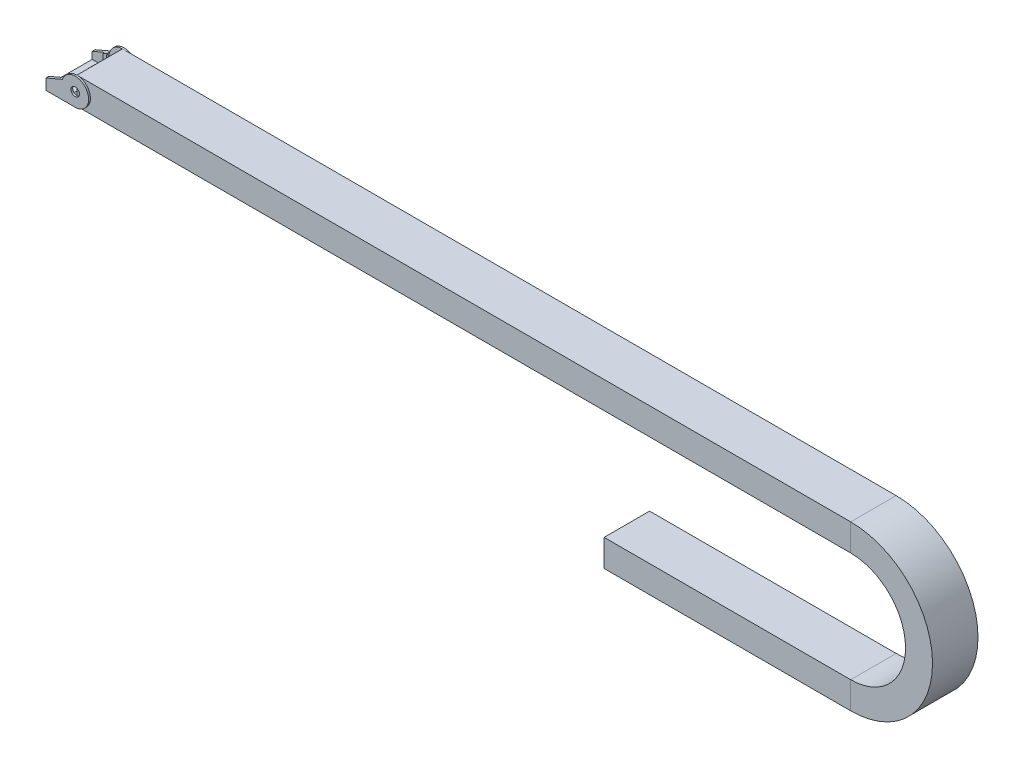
ISO-10303-21;
HEADER;
FILE_DESCRIPTION(('STEP AP214'),'2;1');
FILE_NAME('part.step','',(''),(''),'','','');
FILE_SCHEMA(('AUTOMOTIVE_DESIGN { 1 0 10303 214 1 1 1 1 }'));
ENDSEC;
DATA;
#1=APPLICATION_CONTEXT('core data for automotive mechanical design processes');
#2=APPLICATION_PROTOCOL_DEFINITION('international standard','automotive_design',2000,#1);
#3=PRODUCT_CONTEXT('',#1,'mechanical');
#4=PRODUCT('Part','Part','',(#3));
#5=PRODUCT_RELATED_PRODUCT_CATEGORY('part','',(#4));
#6=PRODUCT_DEFINITION_FORMATION('','',#4);
#7=PRODUCT_DEFINITION_CONTEXT('part definition',#1,'design');
#8=PRODUCT_DEFINITION('design','',#6,#7);
#9=PRODUCT_DEFINITION_SHAPE('','',#8);
#10=(LENGTH_UNIT() NAMED_UNIT(*) SI_UNIT(.MILLI.,.METRE.));
#11=(NAMED_UNIT(*) PLANE_ANGLE_UNIT() SI_UNIT($,.RADIAN.));
#12=(NAMED_UNIT(*) SI_UNIT($,.STERADIAN.) SOLID_ANGLE_UNIT());
#13=UNCERTAINTY_MEASURE_WITH_UNIT(LENGTH_MEASURE(1.E-05),#10,'distance_accuracy_value','');
#14=(GEOMETRIC_REPRESENTATION_CONTEXT(3) GLOBAL_UNCERTAINTY_ASSIGNED_CONTEXT((#13)) GLOBAL_UNIT_ASSIGNED_CONTEXT((#10,
#11,#12)) REPRESENTATION_CONTEXT('',''));
#15=CARTESIAN_POINT('',(0.,0.,0.));
#16=DIRECTION('',(0.,0.,1.));
#17=DIRECTION('',(1.,0.,0.));
#18=AXIS2_PLACEMENT_3D('',#15,#16,#17);
#19=CARTESIAN_POINT('',(0.,0.,42.164));
#20=DIRECTION('',(0.,0.,1.));
#21=DIRECTION('',(1.,0.,0.));
#22=AXIS2_PLACEMENT_3D('',#19,#20,#21);
#23=PLANE('',#22);
#24=DIRECTION('',(0.,-1.,0.));
#25=VECTOR('',#24,1.);
#26=CARTESIAN_POINT('',(-76.2,25.019,42.164));
#27=LINE('',#26,#25);
#28=CARTESIAN_POINT('',(-76.2,-7.874,42.164));
#29=VERTEX_POINT('',#28);
#30=CARTESIAN_POINT('',(-76.2,-25.019,42.164));
#31=VERTEX_POINT('',#30);
#32=EDGE_CURVE('E367',#29,#31,#27,.T.);
#33=ORIENTED_EDGE('',*,*,#32,.T.);
#34=DIRECTION('',(1.,0.,0.));
#35=VECTOR('',#34,1.);
#36=CARTESIAN_POINT('',(-86.6480176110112,-25.019,42.164));
#37=LINE('',#36,#35);
#38=CARTESIAN_POINT('',(-86.6480176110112,-25.019,42.164));
#39=VERTEX_POINT('',#38);
#40=EDGE_CURVE('E439',#39,#31,#37,.T.);
#41=ORIENTED_EDGE('',*,*,#40,.F.);
#42=DIRECTION('',(0.,-1.,0.));
#43=VECTOR('',#42,1.);
#44=CARTESIAN_POINT('',(-86.6480176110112,-22.733,42.164));
#45=LINE('',#44,#43);
#46=CARTESIAN_POINT('',(-86.6480176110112,-22.733,42.164));
#47=VERTEX_POINT('',#46);
#48=EDGE_CURVE('E443',#47,#39,#45,.T.);
#49=ORIENTED_EDGE('',*,*,#48,.F.);
#50=CARTESIAN_POINT('',(-76.2,0.,42.164));
#51=DIRECTION('',(0.,0.,1.));
#52=DIRECTION('',(1.,0.,0.));
#53=AXIS2_PLACEMENT_3D('',#50,#51,#52);
#54=CIRCLE('',#53,25.019);
#55=CARTESIAN_POINT('',(-99.9051547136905,8.001,42.164));
#56=VERTEX_POINT('',#55);
#57=EDGE_CURVE('E448',#56,#47,#54,.T.);
#58=ORIENTED_EDGE('',*,*,#57,.F.);
#59=CARTESIAN_POINT('',(-76.2,25.019,42.164));
#60=VERTEX_POINT('',#59);
#61=EDGE_CURVE('E50',#60,#56,#54,.T.);
#62=ORIENTED_EDGE('',*,*,#61,.F.);
#63=CARTESIAN_POINT('',(-76.2,7.874,42.164));
#64=VERTEX_POINT('',#63);
#65=EDGE_CURVE('E363',#60,#64,#27,.T.);
#66=ORIENTED_EDGE('',*,*,#65,.T.);
#67=CARTESIAN_POINT('',(-76.2,0.,42.164));
#68=DIRECTION('',(0.,0.,1.));
#69=DIRECTION('',(1.,0.,0.));
#70=AXIS2_PLACEMENT_3D('',#67,#68,#69);
#71=CIRCLE('',#70,7.874);
#72=EDGE_CURVE('E424',#64,#29,#71,.T.);
#73=ORIENTED_EDGE('',*,*,#72,.T.);
#74=EDGE_LOOP('',(#33,#41,#49,#58,#62,#66,#73));
#75=FACE_BOUND('',#74,.T.);
#76=ADVANCED_FACE('F34',(#75),#23,.F.);
#77=CARTESIAN_POINT('',(0.,0.,-42.164));
#78=DIRECTION('',(0.,0.,-1.));
#79=DIRECTION('',(1.,0.,0.));
#80=AXIS2_PLACEMENT_3D('',#77,#78,#79);
#81=PLANE('',#80);
#82=DIRECTION('',(0.,1.,0.));
#83=VECTOR('',#82,1.);
#84=CARTESIAN_POINT('',(-76.2,25.019,-42.164));
#85=LINE('',#84,#83);
#86=CARTESIAN_POINT('',(-76.2,7.874,-42.164));
#87=VERTEX_POINT('',#86);
#88=CARTESIAN_POINT('',(-76.2,25.019,-42.164));
#89=VERTEX_POINT('',#88);
#90=EDGE_CURVE('E58',#87,#89,#85,.T.);
#91=ORIENTED_EDGE('',*,*,#90,.T.);
#92=CARTESIAN_POINT('',(-76.2,0.,-42.164));
#93=DIRECTION('',(0.,0.,-1.));
#94=DIRECTION('',(-1.,0.,0.));
#95=AXIS2_PLACEMENT_3D('',#92,#93,#94);
#96=CIRCLE('',#95,25.019);
#97=CARTESIAN_POINT('',(-99.9051547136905,8.001,-42.164));
#98=VERTEX_POINT('',#97);
#99=EDGE_CURVE('E436',#89,#98,#96,.F.);
#100=ORIENTED_EDGE('',*,*,#99,.T.);
#101=CARTESIAN_POINT('',(-86.6480176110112,-22.733,-42.164));
#102=VERTEX_POINT('',#101);
#103=EDGE_CURVE('E437',#98,#102,#96,.F.);
#104=ORIENTED_EDGE('',*,*,#103,.T.);
#105=DIRECTION('',(0.,-1.,0.));
#106=VECTOR('',#105,1.);
#107=CARTESIAN_POINT('',(-86.6480176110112,-22.733,-42.164));
#108=LINE('',#107,#106);
#109=CARTESIAN_POINT('',(-86.6480176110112,-25.019,-42.164));
#110=VERTEX_POINT('',#109);
#111=EDGE_CURVE('E427',#102,#110,#108,.T.);
#112=ORIENTED_EDGE('',*,*,#111,.T.);
#113=DIRECTION('',(1.,0.,0.));
#114=VECTOR('',#113,1.);
#115=CARTESIAN_POINT('',(-86.6480176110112,-25.019,-42.164));
#116=LINE('',#115,#114);
#117=CARTESIAN_POINT('',(-76.2,-25.019,-42.164));
#118=VERTEX_POINT('',#117);
#119=EDGE_CURVE('E431',#110,#118,#116,.T.);
#120=ORIENTED_EDGE('',*,*,#119,.T.);
#121=CARTESIAN_POINT('',(-76.2,-7.874,-42.164));
#122=VERTEX_POINT('',#121);
#123=EDGE_CURVE('E404',#118,#122,#85,.T.);
#124=ORIENTED_EDGE('',*,*,#123,.T.);
#125=CARTESIAN_POINT('',(-76.2,0.,-42.164));
#126=DIRECTION('',(0.,0.,-1.));
#127=DIRECTION('',(-1.,0.,0.));
#128=AXIS2_PLACEMENT_3D('',#125,#126,#127);
#129=CIRCLE('',#128,7.874);
#130=EDGE_CURVE('E421',#122,#87,#129,.T.);
#131=ORIENTED_EDGE('',*,*,#130,.T.);
#132=EDGE_LOOP('',(#91,#100,#104,#112,#120,#124,#131));
#133=FACE_BOUND('',#132,.T.);
#134=ADVANCED_FACE('F734',(#133),#81,.F.);
#135=CARTESIAN_POINT('',(-107.188,-17.907,77.9358962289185));
#136=DIRECTION('',(0.,1.,0.));
#137=DIRECTION('',(0.,0.,1.));
#138=AXIS2_PLACEMENT_3D('',#135,#136,#137);
#139=PLANE('',#138);
#140=DIRECTION('',(0.,0.,-1.));
#141=VECTOR('',#140,1.);
#142=CARTESIAN_POINT('',(-107.188,-17.907,33.274));
#143=LINE('',#142,#141);
#144=CARTESIAN_POINT('',(-107.188,-17.907,33.274));
#145=VERTEX_POINT('',#144);
#146=CARTESIAN_POINT('',(-107.188,-17.907,21.844));
#147=VERTEX_POINT('',#146);
#148=EDGE_CURVE('E522',#145,#147,#143,.T.);
#149=ORIENTED_EDGE('',*,*,#148,.F.);
#150=CARTESIAN_POINT('',(-113.284,-17.907,33.274));
#151=DIRECTION('',(0.,-1.,0.));
#152=DIRECTION('',(0.,0.,1.));
#153=AXIS2_PLACEMENT_3D('',#150,#151,#152);
#154=CIRCLE('',#153,6.09600000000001);
#155=CARTESIAN_POINT('',(-119.38,-17.907,33.274));
#156=VERTEX_POINT('',#155);
#157=EDGE_CURVE('E531',#156,#145,#154,.F.);
#158=ORIENTED_EDGE('',*,*,#157,.F.);
#159=DIRECTION('',(0.,0.,1.));
#160=VECTOR('',#159,1.);
#161=CARTESIAN_POINT('',(-119.38,-17.907,21.844));
#162=LINE('',#161,#160);
#163=CARTESIAN_POINT('',(-119.38,-17.907,21.844));
#164=VERTEX_POINT('',#163);
#165=EDGE_CURVE('E536',#164,#156,#162,.T.);
#166=ORIENTED_EDGE('',*,*,#165,.F.);
#167=CARTESIAN_POINT('',(-113.284,-17.907,21.844));
#168=DIRECTION('',(0.,-1.,0.));
#169=DIRECTION('',(0.,0.,1.));
#170=AXIS2_PLACEMENT_3D('',#167,#168,#169);
#171=CIRCLE('',#170,6.09600000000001);
#172=EDGE_CURVE('E540',#147,#164,#171,.F.);
#173=ORIENTED_EDGE('',*,*,#172,.F.);
#174=EDGE_LOOP('',(#149,#158,#166,#173));
#175=FACE_BOUND('',#174,.T.);
#176=DIRECTION('',(0.,0.,-1.));
#177=VECTOR('',#176,1.);
#178=CARTESIAN_POINT('',(-107.188,-17.907,-33.274));
#179=LINE('',#178,#177);
#180=CARTESIAN_POINT('',(-107.188,-17.907,-33.274));
#181=VERTEX_POINT('',#180);
#182=CARTESIAN_POINT('',(-107.188,-17.907,-21.844));
#183=VERTEX_POINT('',#182);
#184=EDGE_CURVE('E480',#181,#183,#179,.F.);
#185=ORIENTED_EDGE('',*,*,#184,.T.);
#186=CARTESIAN_POINT('',(-113.284,-17.907,-21.844));
#187=DIRECTION('',(0.,-1.,0.));
#188=DIRECTION('',(0.,0.,1.));
#189=AXIS2_PLACEMENT_3D('',#186,#187,#188);
#190=CIRCLE('',#189,6.09600000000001);
#191=CARTESIAN_POINT('',(-119.38,-17.907,-21.844));
#192=VERTEX_POINT('',#191);
#193=EDGE_CURVE('E476',#183,#192,#190,.T.);
#194=ORIENTED_EDGE('',*,*,#193,.T.);
#195=DIRECTION('',(0.,0.,1.));
#196=VECTOR('',#195,1.);
#197=CARTESIAN_POINT('',(-119.38,-17.907,-21.844));
#198=LINE('',#197,#196);
#199=CARTESIAN_POINT('',(-119.38,-17.907,-33.274));
#200=VERTEX_POINT('',#199);
#201=EDGE_CURVE('E486',#192,#200,#198,.F.);
#202=ORIENTED_EDGE('',*,*,#201,.T.);
#203=CARTESIAN_POINT('',(-113.284,-17.907,-33.274));
#204=DIRECTION('',(0.,-1.,0.));
#205=DIRECTION('',(0.,0.,1.));
#206=AXIS2_PLACEMENT_3D('',#203,#204,#205);
#207=CIRCLE('',#206,6.09600000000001);
#208=EDGE_CURVE('E483',#200,#181,#207,.T.);
#209=ORIENTED_EDGE('',*,*,#208,.T.);
#210=EDGE_LOOP('',(#185,#194,#202,#209));
#211=FACE_BOUND('',#210,.T.);
#212=DIRECTION('',(-1.,0.,0.));
#213=VECTOR('',#212,1.);
#214=CARTESIAN_POINT('',(-90.424,-17.907,37.465));
#215=LINE('',#214,#213);
#216=CARTESIAN_POINT('',(-93.6725416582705,-17.907,37.465));
#217=VERTEX_POINT('',#216);
#218=CARTESIAN_POINT('',(-107.188,-17.907,37.465));
#219=VERTEX_POINT('',#218);
#220=EDGE_CURVE('E623',#217,#219,#215,.T.);
#221=ORIENTED_EDGE('',*,*,#220,.F.);
#222=DIRECTION('',(0.,0.,-1.));
#223=VECTOR('',#222,1.);
#224=CARTESIAN_POINT('',(-93.6725416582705,-17.907,112.928418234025));
#225=LINE('',#224,#223);
#226=CARTESIAN_POINT('',(-93.6725416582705,-17.907,-37.4649999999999));
#227=VERTEX_POINT('',#226);
#228=EDGE_CURVE('E442',#217,#227,#225,.T.);
#229=ORIENTED_EDGE('',*,*,#228,.T.);
#230=DIRECTION('',(-1.,0.,0.));
#231=VECTOR('',#230,1.);
#232=CARTESIAN_POINT('',(-90.424,-17.907,-37.465));
#233=LINE('',#232,#231);
#234=CARTESIAN_POINT('',(-107.188,-17.907,-37.465));
#235=VERTEX_POINT('',#234);
#236=EDGE_CURVE('E613',#227,#235,#233,.T.);
#237=ORIENTED_EDGE('',*,*,#236,.T.);
#238=DIRECTION('',(0.,0.,-1.));
#239=VECTOR('',#238,1.);
#240=CARTESIAN_POINT('',(-107.188,-17.907,77.9358962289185));
#241=LINE('',#240,#239);
#242=CARTESIAN_POINT('',(-107.188,-17.907,-40.132));
#243=VERTEX_POINT('',#242);
#244=EDGE_CURVE('E662',#235,#243,#241,.T.);
#245=ORIENTED_EDGE('',*,*,#244,.T.);
#246=DIRECTION('',(1.,0.,0.));
#247=VECTOR('',#246,1.);
#248=CARTESIAN_POINT('',(-107.188,-17.907,-40.132));
#249=LINE('',#248,#247);
#250=CARTESIAN_POINT('',(-130.302,-17.907,-40.132));
#251=VERTEX_POINT('',#250);
#252=EDGE_CURVE('E635',#251,#243,#249,.T.);
#253=ORIENTED_EDGE('',*,*,#252,.F.);
#254=DIRECTION('',(0.,0.,-1.));
#255=VECTOR('',#254,1.);
#256=CARTESIAN_POINT('',(-130.302,-17.907,77.9358962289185));
#257=LINE('',#256,#255);
#258=CARTESIAN_POINT('',(-130.302,-17.907,40.132));
#259=VERTEX_POINT('',#258);
#260=EDGE_CURVE('E658',#259,#251,#257,.T.);
#261=ORIENTED_EDGE('',*,*,#260,.F.);
#262=DIRECTION('',(-1.,0.,0.));
#263=VECTOR('',#262,1.);
#264=CARTESIAN_POINT('',(-107.188,-17.907,40.132));
#265=LINE('',#264,#263);
#266=CARTESIAN_POINT('',(-107.188,-17.907,40.132));
#267=VERTEX_POINT('',#266);
#268=EDGE_CURVE('E646',#267,#259,#265,.T.);
#269=ORIENTED_EDGE('',*,*,#268,.F.);
#270=EDGE_CURVE('E663',#267,#219,#241,.T.);
#271=ORIENTED_EDGE('',*,*,#270,.T.);
#272=EDGE_LOOP('',(#221,#229,#237,#245,#253,#261,#269,#271));
#273=FACE_BOUND('',#272,.T.);
#274=ADVANCED_FACE('F801',(#175,#211,#273),#139,.T.);
#275=CARTESIAN_POINT('',(-76.2,-25.019,45.466));
#276=DIRECTION('',(0.,1.,0.));
#277=DIRECTION('',(0.,0.,1.));
#278=AXIS2_PLACEMENT_3D('',#275,#276,#277);
#279=PLANE('',#278);
#280=DIRECTION('',(0.,0.,-1.));
#281=VECTOR('',#280,1.);
#282=CARTESIAN_POINT('',(-110.236,-25.019,33.274));
#283=LINE('',#282,#281);
#284=CARTESIAN_POINT('',(-110.236,-25.019,33.274));
#285=VERTEX_POINT('',#284);
#286=CARTESIAN_POINT('',(-110.236,-25.019,21.844));
#287=VERTEX_POINT('',#286);
#288=EDGE_CURVE('E564',#285,#287,#283,.T.);
#289=ORIENTED_EDGE('',*,*,#288,.T.);
#290=CARTESIAN_POINT('',(-113.284,-25.019,21.844));
#291=DIRECTION('',(0.,1.,0.));
#292=DIRECTION('',(0.,0.,-1.));
#293=AXIS2_PLACEMENT_3D('',#290,#291,#292);
#294=CIRCLE('',#293,3.048);
#295=CARTESIAN_POINT('',(-116.332,-25.019,21.844));
#296=VERTEX_POINT('',#295);
#297=EDGE_CURVE('E567',#287,#296,#294,.T.);
#298=ORIENTED_EDGE('',*,*,#297,.T.);
#299=DIRECTION('',(0.,0.,1.));
#300=VECTOR('',#299,1.);
#301=CARTESIAN_POINT('',(-116.332,-25.019,33.274));
#302=LINE('',#301,#300);
#303=CARTESIAN_POINT('',(-116.332,-25.019,33.274));
#304=VERTEX_POINT('',#303);
#305=EDGE_CURVE('E552',#296,#304,#302,.T.);
#306=ORIENTED_EDGE('',*,*,#305,.T.);
#307=CARTESIAN_POINT('',(-113.284,-25.019,33.274));
#308=DIRECTION('',(0.,1.,0.));
#309=DIRECTION('',(0.,0.,-1.));
#310=AXIS2_PLACEMENT_3D('',#307,#308,#309);
#311=CIRCLE('',#310,3.048);
#312=EDGE_CURVE('E547',#304,#285,#311,.T.);
#313=ORIENTED_EDGE('',*,*,#312,.T.);
#314=EDGE_LOOP('',(#289,#298,#306,#313));
#315=FACE_BOUND('',#314,.T.);
#316=CARTESIAN_POINT('',(-113.284,-25.019,-33.274));
#317=DIRECTION('',(0.,-1.,0.));
#318=DIRECTION('',(0.,0.,1.));
#319=AXIS2_PLACEMENT_3D('',#316,#317,#318);
#320=CIRCLE('',#319,3.048);
#321=CARTESIAN_POINT('',(-116.332,-25.019,-33.274));
#322=VERTEX_POINT('',#321);
#323=CARTESIAN_POINT('',(-110.236,-25.019,-33.274));
#324=VERTEX_POINT('',#323);
#325=EDGE_CURVE('E479',#322,#324,#320,.T.);
#326=ORIENTED_EDGE('',*,*,#325,.F.);
#327=DIRECTION('',(0.,0.,-1.));
#328=VECTOR('',#327,1.);
#329=CARTESIAN_POINT('',(-116.332,-25.019,-33.274));
#330=LINE('',#329,#328);
#331=CARTESIAN_POINT('',(-116.332,-25.019,-21.844));
#332=VERTEX_POINT('',#331);
#333=EDGE_CURVE('E512',#332,#322,#330,.T.);
#334=ORIENTED_EDGE('',*,*,#333,.F.);
#335=CARTESIAN_POINT('',(-113.284,-25.019,-21.844));
#336=DIRECTION('',(0.,-1.,0.));
#337=DIRECTION('',(0.,0.,1.));
#338=AXIS2_PLACEMENT_3D('',#335,#336,#337);
#339=CIRCLE('',#338,3.048);
#340=CARTESIAN_POINT('',(-110.236,-25.019,-21.844));
#341=VERTEX_POINT('',#340);
#342=EDGE_CURVE('E515',#341,#332,#339,.T.);
#343=ORIENTED_EDGE('',*,*,#342,.F.);
#344=DIRECTION('',(0.,0.,1.));
#345=VECTOR('',#344,1.);
#346=CARTESIAN_POINT('',(-110.236,-25.019,-33.274));
#347=LINE('',#346,#345);
#348=EDGE_CURVE('E500',#324,#341,#347,.T.);
#349=ORIENTED_EDGE('',*,*,#348,.F.);
#350=EDGE_LOOP('',(#326,#334,#343,#349));
#351=FACE_BOUND('',#350,.T.);
#352=DIRECTION('',(0.,0.,-1.));
#353=VECTOR('',#352,1.);
#354=CARTESIAN_POINT('',(-86.6480176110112,-25.019,112.928418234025));
#355=LINE('',#354,#353);
#356=CARTESIAN_POINT('',(-86.6480176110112,-25.019,37.465));
#357=VERTEX_POINT('',#356);
#358=EDGE_CURVE('E453',#39,#357,#355,.T.);
#359=ORIENTED_EDGE('',*,*,#358,.F.);
#360=ORIENTED_EDGE('',*,*,#40,.T.);
#361=DIRECTION('',(0.,0.,-1.));
#362=VECTOR('',#361,1.);
#363=CARTESIAN_POINT('',(-76.2,-25.019,45.466));
#364=LINE('',#363,#362);
#365=CARTESIAN_POINT('',(-76.2,-25.019,45.466));
#366=VERTEX_POINT('',#365);
#367=EDGE_CURVE('E699',#366,#31,#364,.T.);
#368=ORIENTED_EDGE('',*,*,#367,.F.);
#369=DIRECTION('',(-1.,0.,0.));
#370=VECTOR('',#369,1.);
#371=CARTESIAN_POINT('',(-76.2,-25.019,45.466));
#372=LINE('',#371,#370);
#373=CARTESIAN_POINT('',(-130.302,-25.019,45.466));
#374=VERTEX_POINT('',#373);
#375=EDGE_CURVE('E668',#366,#374,#372,.T.);
#376=ORIENTED_EDGE('',*,*,#375,.T.);
#377=DIRECTION('',(0.,0.,-1.));
#378=VECTOR('',#377,1.);
#379=CARTESIAN_POINT('',(-130.302,-25.019,45.466));
#380=LINE('',#379,#378);
#381=CARTESIAN_POINT('',(-130.302,-25.019,40.132));
#382=VERTEX_POINT('',#381);
#383=EDGE_CURVE('E695',#374,#382,#380,.T.);
#384=ORIENTED_EDGE('',*,*,#383,.T.);
#385=DIRECTION('',(1.,0.,0.));
#386=VECTOR('',#385,1.);
#387=CARTESIAN_POINT('',(-120.396,-25.019,40.132));
#388=LINE('',#387,#386);
#389=CARTESIAN_POINT('',(-120.396,-25.019,40.132));
#390=VERTEX_POINT('',#389);
#391=EDGE_CURVE('E584',#382,#390,#388,.T.);
#392=ORIENTED_EDGE('',*,*,#391,.T.);
#393=DIRECTION('',(0.,0.,-1.));
#394=VECTOR('',#393,1.);
#395=CARTESIAN_POINT('',(-120.396,-25.019,-40.132));
#396=LINE('',#395,#394);
#397=CARTESIAN_POINT('',(-120.396,-25.019,-40.132));
#398=VERTEX_POINT('',#397);
#399=EDGE_CURVE('E574',#390,#398,#396,.T.);
#400=ORIENTED_EDGE('',*,*,#399,.T.);
#401=DIRECTION('',(-1.,0.,0.));
#402=VECTOR('',#401,1.);
#403=CARTESIAN_POINT('',(-120.396,-25.019,-40.132));
#404=LINE('',#403,#402);
#405=CARTESIAN_POINT('',(-130.302,-25.019,-40.132));
#406=VERTEX_POINT('',#405);
#407=EDGE_CURVE('E594',#398,#406,#404,.T.);
#408=ORIENTED_EDGE('',*,*,#407,.T.);
#409=CARTESIAN_POINT('',(-130.302,-25.019,-45.466));
#410=VERTEX_POINT('',#409);
#411=EDGE_CURVE('E694',#406,#410,#380,.T.);
#412=ORIENTED_EDGE('',*,*,#411,.T.);
#413=DIRECTION('',(-1.,0.,0.));
#414=VECTOR('',#413,1.);
#415=CARTESIAN_POINT('',(-76.2,-25.019,-45.466));
#416=LINE('',#415,#414);
#417=CARTESIAN_POINT('',(-76.2,-25.019,-45.466));
#418=VERTEX_POINT('',#417);
#419=EDGE_CURVE('E649',#418,#410,#416,.T.);
#420=ORIENTED_EDGE('',*,*,#419,.F.);
#421=EDGE_CURVE('E698',#118,#418,#364,.T.);
#422=ORIENTED_EDGE('',*,*,#421,.F.);
#423=ORIENTED_EDGE('',*,*,#119,.F.);
#424=CARTESIAN_POINT('',(-86.6480176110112,-25.019,-37.4649999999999));
#425=VERTEX_POINT('',#424);
#426=EDGE_CURVE('E452',#425,#110,#355,.T.);
#427=ORIENTED_EDGE('',*,*,#426,.F.);
#428=DIRECTION('',(-1.,0.,0.));
#429=VECTOR('',#428,1.);
#430=CARTESIAN_POINT('',(-76.2,-25.019,-37.465));
#431=LINE('',#430,#429);
#432=CARTESIAN_POINT('',(-90.424,-25.019,-37.465));
#433=VERTEX_POINT('',#432);
#434=EDGE_CURVE('E607',#425,#433,#431,.T.);
#435=ORIENTED_EDGE('',*,*,#434,.T.);
#436=DIRECTION('',(0.,0.,1.));
#437=VECTOR('',#436,1.);
#438=CARTESIAN_POINT('',(-90.424,-25.019,-37.465));
#439=LINE('',#438,#437);
#440=CARTESIAN_POINT('',(-90.424,-25.019,37.465));
#441=VERTEX_POINT('',#440);
#442=EDGE_CURVE('E618',#433,#441,#439,.T.);
#443=ORIENTED_EDGE('',*,*,#442,.T.);
#444=DIRECTION('',(-1.,0.,0.));
#445=VECTOR('',#444,1.);
#446=CARTESIAN_POINT('',(-76.2,-25.019,37.465));
#447=LINE('',#446,#445);
#448=EDGE_CURVE('E601',#357,#441,#447,.T.);
#449=ORIENTED_EDGE('',*,*,#448,.F.);
#450=EDGE_LOOP('',(#359,#360,#368,#376,#384,#392,#400,#408,#412,#420,#422,#423,#427,#435,#443,#449));
#451=FACE_BOUND('',#450,.T.);
#452=ADVANCED_FACE('F722',(#315,#351,#451),#279,.F.);
#453=CARTESIAN_POINT('',(-90.424,-25.019,-37.465));
#454=DIRECTION('',(-1.,0.,0.));
#455=DIRECTION('',(0.,0.,-1.));
#456=AXIS2_PLACEMENT_3D('',#453,#454,#455);
#457=PLANE('',#456);
#458=DIRECTION('',(0.,0.,-1.));
#459=VECTOR('',#458,1.);
#460=CARTESIAN_POINT('',(-90.424,-20.5822298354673,112.928418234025));
#461=LINE('',#460,#459);
#462=CARTESIAN_POINT('',(-90.424,-20.5822298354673,37.465));
#463=VERTEX_POINT('',#462);
#464=CARTESIAN_POINT('',(-90.424,-20.5822298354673,-37.465));
#465=VERTEX_POINT('',#464);
#466=EDGE_CURVE('E460',#463,#465,#461,.T.);
#467=ORIENTED_EDGE('',*,*,#466,.F.);
#468=DIRECTION('',(0.,1.,0.));
#469=VECTOR('',#468,1.);
#470=CARTESIAN_POINT('',(-90.424,-25.019,37.465));
#471=LINE('',#470,#469);
#472=EDGE_CURVE('E620',#441,#463,#471,.T.);
#473=ORIENTED_EDGE('',*,*,#472,.F.);
#474=ORIENTED_EDGE('',*,*,#442,.F.);
#475=DIRECTION('',(0.,1.,0.));
#476=VECTOR('',#475,1.);
#477=CARTESIAN_POINT('',(-90.424,-25.019,-37.465));
#478=LINE('',#477,#476);
#479=EDGE_CURVE('E609',#433,#465,#478,.T.);
#480=ORIENTED_EDGE('',*,*,#479,.T.);
#481=EDGE_LOOP('',(#467,#473,#474,#480));
#482=FACE_BOUND('',#481,.T.);
#483=ADVANCED_FACE('F715',(#482),#457,.F.);
#484=CARTESIAN_POINT('',(-76.2,0.,-37.465));
#485=DIRECTION('',(0.,0.,1.));
#486=DIRECTION('',(-1.,0.,0.));
#487=AXIS2_PLACEMENT_3D('',#484,#485,#486);
#488=PLANE('',#487);
#489=ORIENTED_EDGE('',*,*,#434,.F.);
#490=DIRECTION('',(0.,1.,0.));
#491=VECTOR('',#490,1.);
#492=CARTESIAN_POINT('',(-86.6480176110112,0.,-37.465));
#493=LINE('',#492,#491);
#494=CARTESIAN_POINT('',(-86.6480176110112,-22.733,-37.4649999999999));
#495=VERTEX_POINT('',#494);
#496=EDGE_CURVE('E466',#425,#495,#493,.T.);
#497=ORIENTED_EDGE('',*,*,#496,.T.);
#498=CARTESIAN_POINT('',(-76.2,0.,-37.465));
#499=DIRECTION('',(0.,0.,1.));
#500=DIRECTION('',(1.,0.,0.));
#501=AXIS2_PLACEMENT_3D('',#498,#499,#500);
#502=CIRCLE('',#501,25.019);
#503=EDGE_CURVE('E461',#495,#465,#502,.F.);
#504=ORIENTED_EDGE('',*,*,#503,.T.);
#505=ORIENTED_EDGE('',*,*,#479,.F.);
#506=EDGE_LOOP('',(#489,#497,#504,#505));
#507=FACE_BOUND('',#506,.T.);
#508=ADVANCED_FACE('F727',(#507),#488,.T.);
#509=ORIENTED_EDGE('',*,*,#236,.F.);
#510=CARTESIAN_POINT('',(-99.9051547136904,8.001,-37.465));
#511=VERTEX_POINT('',#510);
#512=EDGE_CURVE('E457',#227,#511,#502,.F.);
#513=ORIENTED_EDGE('',*,*,#512,.T.);
#514=DIRECTION('',(0.919945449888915,0.392046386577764,0.));
#515=VECTOR('',#514,1.);
#516=CARTESIAN_POINT('',(-130.302,-4.953,-37.465));
#517=LINE('',#516,#515);
#518=CARTESIAN_POINT('',(-107.188,4.89732338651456,-37.465));
#519=VERTEX_POINT('',#518);
#520=EDGE_CURVE('E615',#519,#511,#517,.T.);
#521=ORIENTED_EDGE('',*,*,#520,.F.);
#522=DIRECTION('',(0.,-1.,0.));
#523=VECTOR('',#522,1.);
#524=CARTESIAN_POINT('',(-107.188,4.89732338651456,-37.465));
#525=LINE('',#524,#523);
#526=EDGE_CURVE('E632',#519,#235,#525,.T.);
#527=ORIENTED_EDGE('',*,*,#526,.T.);
#528=EDGE_LOOP('',(#509,#513,#521,#527));
#529=FACE_BOUND('',#528,.T.);
#530=ADVANCED_FACE('F890',(#529),#488,.T.);
#531=CARTESIAN_POINT('',(-76.2,0.,37.465));
#532=DIRECTION('',(0.,0.,1.));
#533=DIRECTION('',(-1.,0.,0.));
#534=AXIS2_PLACEMENT_3D('',#531,#532,#533);
#535=PLANE('',#534);
#536=DIRECTION('',(0.,1.,0.));
#537=VECTOR('',#536,1.);
#538=CARTESIAN_POINT('',(-86.6480176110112,0.,37.465));
#539=LINE('',#538,#537);
#540=CARTESIAN_POINT('',(-86.6480176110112,-22.733,37.465));
#541=VERTEX_POINT('',#540);
#542=EDGE_CURVE('E12',#357,#541,#539,.T.);
#543=ORIENTED_EDGE('',*,*,#542,.F.);
#544=ORIENTED_EDGE('',*,*,#448,.T.);
#545=ORIENTED_EDGE('',*,*,#472,.T.);
#546=CARTESIAN_POINT('',(-76.2,0.,37.465));
#547=DIRECTION('',(0.,0.,1.));
#548=DIRECTION('',(1.,0.,0.));
#549=AXIS2_PLACEMENT_3D('',#546,#547,#548);
#550=CIRCLE('',#549,25.019);
#551=EDGE_CURVE('E43',#541,#463,#550,.F.);
#552=ORIENTED_EDGE('',*,*,#551,.F.);
#553=EDGE_LOOP('',(#543,#544,#545,#552));
#554=FACE_BOUND('',#553,.T.);
#555=ADVANCED_FACE('F718',(#554),#535,.F.);
#556=CARTESIAN_POINT('',(-99.9051547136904,8.001,37.465));
#557=VERTEX_POINT('',#556);
#558=EDGE_CURVE('E702',#217,#557,#550,.F.);
#559=ORIENTED_EDGE('',*,*,#558,.F.);
#560=ORIENTED_EDGE('',*,*,#220,.T.);
#561=DIRECTION('',(0.,-1.,0.));
#562=VECTOR('',#561,1.);
#563=CARTESIAN_POINT('',(-107.188,4.89732338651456,37.465));
#564=LINE('',#563,#562);
#565=CARTESIAN_POINT('',(-107.188,4.89732338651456,37.465));
#566=VERTEX_POINT('',#565);
#567=EDGE_CURVE('E629',#566,#219,#564,.T.);
#568=ORIENTED_EDGE('',*,*,#567,.F.);
#569=DIRECTION('',(0.919945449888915,0.392046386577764,0.));
#570=VECTOR('',#569,1.);
#571=CARTESIAN_POINT('',(-130.302,-4.953,37.465));
#572=LINE('',#571,#570);
#573=EDGE_CURVE('E610',#566,#557,#572,.T.);
#574=ORIENTED_EDGE('',*,*,#573,.T.);
#575=EDGE_LOOP('',(#559,#560,#568,#574));
#576=FACE_BOUND('',#575,.T.);
#577=ADVANCED_FACE('F893',(#576),#535,.F.);
#578=CARTESIAN_POINT('',(-76.2,0.,45.466));
#579=DIRECTION('',(0.,0.,-1.));
#580=DIRECTION('',(1.,0.,0.));
#581=AXIS2_PLACEMENT_3D('',#578,#579,#580);
#582=CYLINDRICAL_SURFACE('',#581,25.019);
#583=DIRECTION('',(0.,0.,-1.));
#584=VECTOR('',#583,1.);
#585=CARTESIAN_POINT('',(-99.9051547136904,8.001,45.466));
#586=LINE('',#585,#584);
#587=CARTESIAN_POINT('',(-99.9051547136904,8.001,-45.466));
#588=VERTEX_POINT('',#587);
#589=EDGE_CURVE('E678',#98,#588,#586,.T.);
#590=ORIENTED_EDGE('',*,*,#589,.F.);
#591=ORIENTED_EDGE('',*,*,#99,.F.);
#592=EDGE_CURVE('E432',#118,#89,#96,.F.);
#593=ORIENTED_EDGE('',*,*,#592,.F.);
#594=ORIENTED_EDGE('',*,*,#421,.T.);
#595=CARTESIAN_POINT('',(-76.2,0.,-45.466));
#596=DIRECTION('',(0.,0.,1.));
#597=DIRECTION('',(1.,0.,0.));
#598=AXIS2_PLACEMENT_3D('',#595,#596,#597);
#599=CIRCLE('',#598,25.019);
#600=EDGE_CURVE('E469',#418,#588,#599,.T.);
#601=ORIENTED_EDGE('',*,*,#600,.T.);
#602=EDGE_LOOP('',(#590,#591,#593,#594,#601));
#603=FACE_BOUND('',#602,.T.);
#604=ADVANCED_FACE('F1159',(#603),#582,.T.);
#605=ORIENTED_EDGE('',*,*,#367,.T.);
#606=EDGE_CURVE('E446',#31,#60,#54,.T.);
#607=ORIENTED_EDGE('',*,*,#606,.T.);
#608=ORIENTED_EDGE('',*,*,#61,.T.);
#609=CARTESIAN_POINT('',(-99.9051547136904,8.001,45.466));
#610=VERTEX_POINT('',#609);
#611=EDGE_CURVE('E686',#610,#56,#586,.T.);
#612=ORIENTED_EDGE('',*,*,#611,.F.);
#613=CARTESIAN_POINT('',(-76.2,0.,45.466));
#614=DIRECTION('',(0.,0.,1.));
#615=DIRECTION('',(1.,0.,0.));
#616=AXIS2_PLACEMENT_3D('',#613,#614,#615);
#617=CIRCLE('',#616,25.019);
#618=EDGE_CURVE('E472',#366,#610,#617,.T.);
#619=ORIENTED_EDGE('',*,*,#618,.F.);
#620=EDGE_LOOP('',(#605,#607,#608,#612,#619));
#621=FACE_BOUND('',#620,.T.);
#622=ADVANCED_FACE('F36',(#621),#582,.T.);
#623=CARTESIAN_POINT('',(-130.302,-4.953,45.466));
#624=DIRECTION('',(0.392046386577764,-0.919945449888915,0.));
#625=DIRECTION('',(-0.919945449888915,-0.392046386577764,0.));
#626=AXIS2_PLACEMENT_3D('',#623,#624,#625);
#627=PLANE('',#626);
#628=ORIENTED_EDGE('',*,*,#520,.T.);
#629=EDGE_CURVE('E690',#511,#98,#586,.T.);
#630=ORIENTED_EDGE('',*,*,#629,.T.);
#631=ORIENTED_EDGE('',*,*,#589,.T.);
#632=DIRECTION('',(0.919945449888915,0.392046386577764,0.));
#633=VECTOR('',#632,1.);
#634=CARTESIAN_POINT('',(-130.302,-4.953,-45.466));
#635=LINE('',#634,#633);
#636=CARTESIAN_POINT('',(-130.302,-4.953,-45.466));
#637=VERTEX_POINT('',#636);
#638=EDGE_CURVE('E672',#637,#588,#635,.T.);
#639=ORIENTED_EDGE('',*,*,#638,.F.);
#640=DIRECTION('',(0.,0.,-1.));
#641=VECTOR('',#640,1.);
#642=CARTESIAN_POINT('',(-130.302,-4.953,45.466));
#643=LINE('',#642,#641);
#644=CARTESIAN_POINT('',(-130.302,-4.953,-40.132));
#645=VERTEX_POINT('',#644);
#646=EDGE_CURVE('E689',#645,#637,#643,.T.);
#647=ORIENTED_EDGE('',*,*,#646,.F.);
#648=DIRECTION('',(-0.919945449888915,-0.392046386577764,0.));
#649=VECTOR('',#648,1.);
#650=CARTESIAN_POINT('',(-130.302,-4.953,-40.132));
#651=LINE('',#650,#649);
#652=CARTESIAN_POINT('',(-107.188,4.89732338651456,-40.132));
#653=VERTEX_POINT('',#652);
#654=EDGE_CURVE('E640',#653,#645,#651,.T.);
#655=ORIENTED_EDGE('',*,*,#654,.F.);
#656=DIRECTION('',(0.,0.,-1.));
#657=VECTOR('',#656,1.);
#658=CARTESIAN_POINT('',(-107.188,4.89732338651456,77.9358962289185));
#659=LINE('',#658,#657);
#660=EDGE_CURVE('E645',#519,#653,#659,.T.);
#661=ORIENTED_EDGE('',*,*,#660,.F.);
#662=EDGE_LOOP('',(#628,#630,#631,#639,#647,#655,#661));
#663=FACE_BOUND('',#662,.T.);
#664=ADVANCED_FACE('F924',(#663),#627,.F.);
#665=CARTESIAN_POINT('',(-107.188,4.89732338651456,77.9358962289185));
#666=DIRECTION('',(-1.,0.,0.));
#667=DIRECTION('',(0.,1.,0.));
#668=AXIS2_PLACEMENT_3D('',#665,#666,#667);
#669=PLANE('',#668);
#670=ORIENTED_EDGE('',*,*,#660,.T.);
#671=DIRECTION('',(0.,1.,0.));
#672=VECTOR('',#671,1.);
#673=CARTESIAN_POINT('',(-107.188,4.89732338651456,-40.132));
#674=LINE('',#673,#672);
#675=EDGE_CURVE('E643',#243,#653,#674,.T.);
#676=ORIENTED_EDGE('',*,*,#675,.F.);
#677=ORIENTED_EDGE('',*,*,#244,.F.);
#678=ORIENTED_EDGE('',*,*,#526,.F.);
#679=EDGE_LOOP('',(#670,#676,#677,#678));
#680=FACE_BOUND('',#679,.T.);
#681=ADVANCED_FACE('F908',(#680),#669,.T.);
#682=CARTESIAN_POINT('',(-130.302,-25.019,45.466));
#683=DIRECTION('',(1.,0.,0.));
#684=DIRECTION('',(0.,0.,1.));
#685=AXIS2_PLACEMENT_3D('',#682,#683,#684);
#686=PLANE('',#685);
#687=ORIENTED_EDGE('',*,*,#383,.F.);
#688=DIRECTION('',(0.,1.,0.));
#689=VECTOR('',#688,1.);
#690=CARTESIAN_POINT('',(-130.302,-25.019,45.466));
#691=LINE('',#690,#689);
#692=CARTESIAN_POINT('',(-130.302,-4.953,45.466));
#693=VERTEX_POINT('',#692);
#694=EDGE_CURVE('E671',#374,#693,#691,.T.);
#695=ORIENTED_EDGE('',*,*,#694,.T.);
#696=CARTESIAN_POINT('',(-130.302,-4.953,40.132));
#697=VERTEX_POINT('',#696);
#698=EDGE_CURVE('E691',#693,#697,#643,.T.);
#699=ORIENTED_EDGE('',*,*,#698,.T.);
#700=DIRECTION('',(0.,1.,0.));
#701=VECTOR('',#700,1.);
#702=CARTESIAN_POINT('',(-130.302,-17.907,40.132));
#703=LINE('',#702,#701);
#704=EDGE_CURVE('E655',#259,#697,#703,.T.);
#705=ORIENTED_EDGE('',*,*,#704,.F.);
#706=ORIENTED_EDGE('',*,*,#260,.T.);
#707=DIRECTION('',(0.,-1.,0.));
#708=VECTOR('',#707,1.);
#709=CARTESIAN_POINT('',(-130.302,-17.907,-40.132));
#710=LINE('',#709,#708);
#711=EDGE_CURVE('E638',#645,#251,#710,.T.);
#712=ORIENTED_EDGE('',*,*,#711,.F.);
#713=ORIENTED_EDGE('',*,*,#646,.T.);
#714=DIRECTION('',(0.,1.,0.));
#715=VECTOR('',#714,1.);
#716=CARTESIAN_POINT('',(-130.302,-25.019,-45.466));
#717=LINE('',#716,#715);
#718=EDGE_CURVE('E681',#410,#637,#717,.T.);
#719=ORIENTED_EDGE('',*,*,#718,.F.);
#720=ORIENTED_EDGE('',*,*,#411,.F.);
#721=DIRECTION('',(0.,-1.,0.));
#722=VECTOR('',#721,1.);
#723=CARTESIAN_POINT('',(-130.302,-22.987,-40.132));
#724=LINE('',#723,#722);
#725=CARTESIAN_POINT('',(-130.302,-22.987,-40.132));
#726=VERTEX_POINT('',#725);
#727=EDGE_CURVE('E604',#726,#406,#724,.T.);
#728=ORIENTED_EDGE('',*,*,#727,.F.);
#729=DIRECTION('',(0.,0.,1.));
#730=VECTOR('',#729,1.);
#731=CARTESIAN_POINT('',(-130.302,-22.987,-40.132));
#732=LINE('',#731,#730);
#733=CARTESIAN_POINT('',(-130.302,-22.987,40.132));
#734=VERTEX_POINT('',#733);
#735=EDGE_CURVE('E586',#726,#734,#732,.T.);
#736=ORIENTED_EDGE('',*,*,#735,.T.);
#737=DIRECTION('',(0.,-1.,0.));
#738=VECTOR('',#737,1.);
#739=CARTESIAN_POINT('',(-130.302,-22.987,40.132));
#740=LINE('',#739,#738);
#741=EDGE_CURVE('E602',#734,#382,#740,.T.);
#742=ORIENTED_EDGE('',*,*,#741,.T.);
#743=EDGE_LOOP('',(#687,#695,#699,#705,#706,#712,#713,#719,#720,#728,#736,#742));
#744=FACE_BOUND('',#743,.T.);
#745=ADVANCED_FACE('F922',(#744),#686,.F.);
#746=CARTESIAN_POINT('',(-107.188,4.89732338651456,40.132));
#747=VERTEX_POINT('',#746);
#748=EDGE_CURVE('E659',#747,#566,#659,.T.);
#749=ORIENTED_EDGE('',*,*,#748,.F.);
#750=DIRECTION('',(0.919945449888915,0.392046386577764,0.));
#751=VECTOR('',#750,1.);
#752=CARTESIAN_POINT('',(-130.302,-4.953,40.132));
#753=LINE('',#752,#751);
#754=EDGE_CURVE('E652',#697,#747,#753,.T.);
#755=ORIENTED_EDGE('',*,*,#754,.F.);
#756=ORIENTED_EDGE('',*,*,#698,.F.);
#757=DIRECTION('',(0.919945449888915,0.392046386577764,0.));
#758=VECTOR('',#757,1.);
#759=CARTESIAN_POINT('',(-130.302,-4.953,45.466));
#760=LINE('',#759,#758);
#761=EDGE_CURVE('E675',#693,#610,#760,.T.);
#762=ORIENTED_EDGE('',*,*,#761,.T.);
#763=ORIENTED_EDGE('',*,*,#611,.T.);
#764=DIRECTION('',(0.,0.,-1.));
#765=VECTOR('',#764,1.);
#766=CARTESIAN_POINT('',(-99.9051547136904,8.001,112.928418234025));
#767=LINE('',#766,#765);
#768=EDGE_CURVE('E463',#557,#56,#767,.F.);
#769=ORIENTED_EDGE('',*,*,#768,.F.);
#770=ORIENTED_EDGE('',*,*,#573,.F.);
#771=EDGE_LOOP('',(#749,#755,#756,#762,#763,#769,#770));
#772=FACE_BOUND('',#771,.T.);
#773=ADVANCED_FACE('F914',(#772),#627,.F.);
#774=CARTESIAN_POINT('',(-76.2,0.,45.466));
#775=DIRECTION('',(0.,0.,1.));
#776=DIRECTION('',(-1.,0.,0.));
#777=AXIS2_PLACEMENT_3D('',#774,#775,#776);
#778=PLANE('',#777);
#779=CARTESIAN_POINT('',(-76.2,0.,45.466));
#780=DIRECTION('',(0.,0.,1.));
#781=DIRECTION('',(1.,0.,0.));
#782=AXIS2_PLACEMENT_3D('',#779,#780,#781);
#783=CIRCLE('',#782,7.874);
#784=CARTESIAN_POINT('',(-68.326,0.,45.466));
#785=VERTEX_POINT('',#784);
#786=EDGE_CURVE('E417',#785,#785,#783,.T.);
#787=ORIENTED_EDGE('',*,*,#786,.F.);
#788=EDGE_LOOP('',(#787));
#789=FACE_BOUND('',#788,.T.);
#790=ORIENTED_EDGE('',*,*,#618,.T.);
#791=ORIENTED_EDGE('',*,*,#761,.F.);
#792=ORIENTED_EDGE('',*,*,#694,.F.);
#793=ORIENTED_EDGE('',*,*,#375,.F.);
#794=EDGE_LOOP('',(#790,#791,#792,#793));
#795=FACE_BOUND('',#794,.T.);
#796=ADVANCED_FACE('F906',(#789,#795),#778,.T.);
#797=ORIENTED_EDGE('',*,*,#567,.T.);
#798=ORIENTED_EDGE('',*,*,#270,.F.);
#799=DIRECTION('',(0.,-1.,0.));
#800=VECTOR('',#799,1.);
#801=CARTESIAN_POINT('',(-107.188,4.89732338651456,40.132));
#802=LINE('',#801,#800);
#803=EDGE_CURVE('E650',#747,#267,#802,.T.);
#804=ORIENTED_EDGE('',*,*,#803,.F.);
#805=ORIENTED_EDGE('',*,*,#748,.T.);
#806=EDGE_LOOP('',(#797,#798,#804,#805));
#807=FACE_BOUND('',#806,.T.);
#808=ADVANCED_FACE('F903',(#807),#669,.T.);
#809=CARTESIAN_POINT('',(-76.2,0.,40.132));
#810=DIRECTION('',(0.,0.,1.));
#811=DIRECTION('',(-1.,0.,0.));
#812=AXIS2_PLACEMENT_3D('',#809,#810,#811);
#813=PLANE('',#812);
#814=ORIENTED_EDGE('',*,*,#704,.T.);
#815=ORIENTED_EDGE('',*,*,#754,.T.);
#816=ORIENTED_EDGE('',*,*,#803,.T.);
#817=ORIENTED_EDGE('',*,*,#268,.T.);
#818=EDGE_LOOP('',(#814,#815,#816,#817));
#819=FACE_BOUND('',#818,.T.);
#820=ADVANCED_FACE('F898',(#819),#813,.F.);
#821=CARTESIAN_POINT('',(-76.2,0.,-40.132));
#822=DIRECTION('',(0.,0.,1.));
#823=DIRECTION('',(-1.,0.,0.));
#824=AXIS2_PLACEMENT_3D('',#821,#822,#823);
#825=PLANE('',#824);
#826=ORIENTED_EDGE('',*,*,#654,.T.);
#827=ORIENTED_EDGE('',*,*,#711,.T.);
#828=ORIENTED_EDGE('',*,*,#252,.T.);
#829=ORIENTED_EDGE('',*,*,#675,.T.);
#830=EDGE_LOOP('',(#826,#827,#828,#829));
#831=FACE_BOUND('',#830,.T.);
#832=ADVANCED_FACE('F886',(#831),#825,.T.);
#833=CARTESIAN_POINT('',(-120.396,-22.987,-40.132));
#834=DIRECTION('',(1.,0.,0.));
#835=DIRECTION('',(0.,0.,1.));
#836=AXIS2_PLACEMENT_3D('',#833,#834,#835);
#837=PLANE('',#836);
#838=ORIENTED_EDGE('',*,*,#399,.F.);
#839=DIRECTION('',(0.,-1.,0.));
#840=VECTOR('',#839,1.);
#841=CARTESIAN_POINT('',(-120.396,-22.987,40.132));
#842=LINE('',#841,#840);
#843=CARTESIAN_POINT('',(-120.396,-22.987,40.132));
#844=VERTEX_POINT('',#843);
#845=EDGE_CURVE('E599',#844,#390,#842,.T.);
#846=ORIENTED_EDGE('',*,*,#845,.F.);
#847=DIRECTION('',(0.,0.,-1.));
#848=VECTOR('',#847,1.);
#849=CARTESIAN_POINT('',(-120.396,-22.987,-40.132));
#850=LINE('',#849,#848);
#851=CARTESIAN_POINT('',(-120.396,-22.987,-40.132));
#852=VERTEX_POINT('',#851);
#853=EDGE_CURVE('E580',#844,#852,#850,.T.);
#854=ORIENTED_EDGE('',*,*,#853,.T.);
#855=DIRECTION('',(0.,-1.,0.));
#856=VECTOR('',#855,1.);
#857=CARTESIAN_POINT('',(-120.396,-22.987,-40.132));
#858=LINE('',#857,#856);
#859=EDGE_CURVE('E591',#852,#398,#858,.T.);
#860=ORIENTED_EDGE('',*,*,#859,.T.);
#861=EDGE_LOOP('',(#838,#846,#854,#860));
#862=FACE_BOUND('',#861,.T.);
#863=ADVANCED_FACE('F879',(#862),#837,.F.);
#864=CARTESIAN_POINT('',(-120.396,-22.987,40.132));
#865=DIRECTION('',(0.,0.,1.));
#866=DIRECTION('',(-1.,0.,0.));
#867=AXIS2_PLACEMENT_3D('',#864,#865,#866);
#868=PLANE('',#867);
#869=ORIENTED_EDGE('',*,*,#391,.F.);
#870=ORIENTED_EDGE('',*,*,#741,.F.);
#871=DIRECTION('',(1.,0.,0.));
#872=VECTOR('',#871,1.);
#873=CARTESIAN_POINT('',(-120.396,-22.987,40.132));
#874=LINE('',#873,#872);
#875=EDGE_CURVE('E589',#734,#844,#874,.T.);
#876=ORIENTED_EDGE('',*,*,#875,.T.);
#877=ORIENTED_EDGE('',*,*,#845,.T.);
#878=EDGE_LOOP('',(#869,#870,#876,#877));
#879=FACE_BOUND('',#878,.T.);
#880=ADVANCED_FACE('F876',(#879),#868,.F.);
#881=CARTESIAN_POINT('',(-120.396,-22.987,-40.132));
#882=DIRECTION('',(0.,0.,-1.));
#883=DIRECTION('',(1.,0.,0.));
#884=AXIS2_PLACEMENT_3D('',#881,#882,#883);
#885=PLANE('',#884);
#886=ORIENTED_EDGE('',*,*,#407,.F.);
#887=ORIENTED_EDGE('',*,*,#859,.F.);
#888=DIRECTION('',(-1.,0.,0.));
#889=VECTOR('',#888,1.);
#890=CARTESIAN_POINT('',(-120.396,-22.987,-40.132));
#891=LINE('',#890,#889);
#892=EDGE_CURVE('E583',#852,#726,#891,.T.);
#893=ORIENTED_EDGE('',*,*,#892,.T.);
#894=ORIENTED_EDGE('',*,*,#727,.T.);
#895=EDGE_LOOP('',(#886,#887,#893,#894));
#896=FACE_BOUND('',#895,.T.);
#897=ADVANCED_FACE('F874',(#896),#885,.F.);
#898=CARTESIAN_POINT('',(-120.396,-22.987,40.132));
#899=DIRECTION('',(0.,1.,0.));
#900=DIRECTION('',(0.,0.,1.));
#901=AXIS2_PLACEMENT_3D('',#898,#899,#900);
#902=PLANE('',#901);
#903=ORIENTED_EDGE('',*,*,#853,.F.);
#904=ORIENTED_EDGE('',*,*,#875,.F.);
#905=ORIENTED_EDGE('',*,*,#735,.F.);
#906=ORIENTED_EDGE('',*,*,#892,.F.);
#907=EDGE_LOOP('',(#903,#904,#905,#906));
#908=FACE_BOUND('',#907,.T.);
#909=ADVANCED_FACE('F870',(#908),#902,.F.);
#910=CARTESIAN_POINT('',(-113.284,-20.955,33.274));
#911=DIRECTION('',(0.,-1.,0.));
#912=DIRECTION('',(0.,0.,-1.));
#913=AXIS2_PLACEMENT_3D('',#910,#911,#912);
#914=CYLINDRICAL_SURFACE('',#913,3.048);
#915=ORIENTED_EDGE('',*,*,#312,.F.);
#916=DIRECTION('',(0.,-1.,0.));
#917=VECTOR('',#916,1.);
#918=CARTESIAN_POINT('',(-116.332,-20.955,33.274));
#919=LINE('',#918,#917);
#920=CARTESIAN_POINT('',(-116.332,-20.955,33.274));
#921=VERTEX_POINT('',#920);
#922=EDGE_CURVE('E572',#921,#304,#919,.T.);
#923=ORIENTED_EDGE('',*,*,#922,.F.);
#924=CARTESIAN_POINT('',(-113.284,-20.955,33.274));
#925=DIRECTION('',(0.,1.,0.));
#926=DIRECTION('',(0.,0.,-1.));
#927=AXIS2_PLACEMENT_3D('',#924,#925,#926);
#928=CIRCLE('',#927,3.048);
#929=CARTESIAN_POINT('',(-110.236,-20.955,33.274));
#930=VERTEX_POINT('',#929);
#931=EDGE_CURVE('E548',#921,#930,#928,.T.);
#932=ORIENTED_EDGE('',*,*,#931,.T.);
#933=DIRECTION('',(0.,-1.,0.));
#934=VECTOR('',#933,1.);
#935=CARTESIAN_POINT('',(-110.236,-20.955,33.274));
#936=LINE('',#935,#934);
#937=EDGE_CURVE('E561',#930,#285,#936,.T.);
#938=ORIENTED_EDGE('',*,*,#937,.T.);
#939=EDGE_LOOP('',(#915,#923,#932,#938));
#940=FACE_BOUND('',#939,.T.);
#941=ADVANCED_FACE('F860',(#940),#914,.F.);
#942=CARTESIAN_POINT('',(-116.332,-20.955,33.274));
#943=DIRECTION('',(-1.,0.,0.));
#944=DIRECTION('',(0.,0.,-1.));
#945=AXIS2_PLACEMENT_3D('',#942,#943,#944);
#946=PLANE('',#945);
#947=ORIENTED_EDGE('',*,*,#305,.F.);
#948=DIRECTION('',(0.,-1.,0.));
#949=VECTOR('',#948,1.);
#950=CARTESIAN_POINT('',(-116.332,-20.955,21.844));
#951=LINE('',#950,#949);
#952=CARTESIAN_POINT('',(-116.332,-20.955,21.844));
#953=VERTEX_POINT('',#952);
#954=EDGE_CURVE('E575',#953,#296,#951,.T.);
#955=ORIENTED_EDGE('',*,*,#954,.F.);
#956=DIRECTION('',(0.,0.,1.));
#957=VECTOR('',#956,1.);
#958=CARTESIAN_POINT('',(-116.332,-20.955,33.274));
#959=LINE('',#958,#957);
#960=EDGE_CURVE('E558',#953,#921,#959,.T.);
#961=ORIENTED_EDGE('',*,*,#960,.T.);
#962=ORIENTED_EDGE('',*,*,#922,.T.);
#963=EDGE_LOOP('',(#947,#955,#961,#962));
#964=FACE_BOUND('',#963,.T.);
#965=ADVANCED_FACE('F856',(#964),#946,.F.);
#966=CARTESIAN_POINT('',(-113.284,-20.955,21.844));
#967=DIRECTION('',(0.,-1.,0.));
#968=DIRECTION('',(0.,0.,-1.));
#969=AXIS2_PLACEMENT_3D('',#966,#967,#968);
#970=CYLINDRICAL_SURFACE('',#969,3.048);
#971=ORIENTED_EDGE('',*,*,#297,.F.);
#972=DIRECTION('',(0.,-1.,0.));
#973=VECTOR('',#972,1.);
#974=CARTESIAN_POINT('',(-110.236,-20.955,21.844));
#975=LINE('',#974,#973);
#976=CARTESIAN_POINT('',(-110.236,-20.955,21.844));
#977=VERTEX_POINT('',#976);
#978=EDGE_CURVE('E577',#977,#287,#975,.T.);
#979=ORIENTED_EDGE('',*,*,#978,.F.);
#980=CARTESIAN_POINT('',(-113.284,-20.955,21.844));
#981=DIRECTION('',(0.,1.,0.));
#982=DIRECTION('',(0.,0.,-1.));
#983=AXIS2_PLACEMENT_3D('',#980,#981,#982);
#984=CIRCLE('',#983,3.048);
#985=EDGE_CURVE('E555',#977,#953,#984,.T.);
#986=ORIENTED_EDGE('',*,*,#985,.T.);
#987=ORIENTED_EDGE('',*,*,#954,.T.);
#988=EDGE_LOOP('',(#971,#979,#986,#987));
#989=FACE_BOUND('',#988,.T.);
#990=ADVANCED_FACE('F859',(#989),#970,.F.);
#991=CARTESIAN_POINT('',(-110.236,-20.955,33.274));
#992=DIRECTION('',(1.,0.,0.));
#993=DIRECTION('',(0.,0.,1.));
#994=AXIS2_PLACEMENT_3D('',#991,#992,#993);
#995=PLANE('',#994);
#996=ORIENTED_EDGE('',*,*,#288,.F.);
#997=ORIENTED_EDGE('',*,*,#937,.F.);
#998=DIRECTION('',(0.,0.,-1.));
#999=VECTOR('',#998,1.);
#1000=CARTESIAN_POINT('',(-110.236,-20.955,33.274));
#1001=LINE('',#1000,#999);
#1002=EDGE_CURVE('E551',#930,#977,#1001,.T.);
#1003=ORIENTED_EDGE('',*,*,#1002,.T.);
#1004=ORIENTED_EDGE('',*,*,#978,.T.);
#1005=EDGE_LOOP('',(#996,#997,#1003,#1004));
#1006=FACE_BOUND('',#1005,.T.);
#1007=ADVANCED_FACE('F854',(#1006),#995,.F.);
#1008=CARTESIAN_POINT('',(-110.236,-20.955,33.274));
#1009=DIRECTION('',(0.707106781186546,-0.707106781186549,0.));
#1010=DIRECTION('',(-0.707106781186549,-0.707106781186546,0.));
#1011=AXIS2_PLACEMENT_3D('',#1008,#1009,#1010);
#1012=PLANE('',#1011);
#1013=DIRECTION('',(0.707106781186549,0.707106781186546,0.));
#1014=VECTOR('',#1013,1.);
#1015=CARTESIAN_POINT('',(-110.236,-20.955,33.274));
#1016=LINE('',#1015,#1014);
#1017=EDGE_CURVE('E534',#145,#930,#1016,.F.);
#1018=ORIENTED_EDGE('',*,*,#1017,.F.);
#1019=ORIENTED_EDGE('',*,*,#148,.T.);
#1020=DIRECTION('',(0.707106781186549,0.707106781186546,0.));
#1021=VECTOR('',#1020,1.);
#1022=CARTESIAN_POINT('',(-110.236,-20.955,21.844));
#1023=LINE('',#1022,#1021);
#1024=EDGE_CURVE('E530',#147,#977,#1023,.F.);
#1025=ORIENTED_EDGE('',*,*,#1024,.T.);
#1026=ORIENTED_EDGE('',*,*,#1002,.F.);
#1027=EDGE_LOOP('',(#1018,#1019,#1025,#1026));
#1028=FACE_BOUND('',#1027,.T.);
#1029=ADVANCED_FACE('F850',(#1028),#1012,.F.);
#1030=CARTESIAN_POINT('',(-113.284,-20.955,21.844));
#1031=DIRECTION('',(0.,1.,0.));
#1032=DIRECTION('',(0.,0.,-1.));
#1033=AXIS2_PLACEMENT_3D('',#1030,#1031,#1032);
#1034=CONICAL_SURFACE('',#1033,3.048,0.78539816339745);
#1035=ORIENTED_EDGE('',*,*,#1024,.F.);
#1036=ORIENTED_EDGE('',*,*,#172,.T.);
#1037=DIRECTION('',(-0.707106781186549,0.707106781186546,0.));
#1038=VECTOR('',#1037,1.);
#1039=CARTESIAN_POINT('',(-116.332,-20.955,21.844));
#1040=LINE('',#1039,#1038);
#1041=EDGE_CURVE('E539',#164,#953,#1040,.F.);
#1042=ORIENTED_EDGE('',*,*,#1041,.T.);
#1043=ORIENTED_EDGE('',*,*,#985,.F.);
#1044=EDGE_LOOP('',(#1035,#1036,#1042,#1043));
#1045=FACE_BOUND('',#1044,.T.);
#1046=ADVANCED_FACE('F846',(#1045),#1034,.F.);
#1047=CARTESIAN_POINT('',(-116.332,-20.955,21.844));
#1048=DIRECTION('',(-0.707106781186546,-0.707106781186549,0.));
#1049=DIRECTION('',(-0.707106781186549,0.707106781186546,0.));
#1050=AXIS2_PLACEMENT_3D('',#1047,#1048,#1049);
#1051=PLANE('',#1050);
#1052=ORIENTED_EDGE('',*,*,#1041,.F.);
#1053=ORIENTED_EDGE('',*,*,#165,.T.);
#1054=DIRECTION('',(-0.707106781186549,0.707106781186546,0.));
#1055=VECTOR('',#1054,1.);
#1056=CARTESIAN_POINT('',(-116.332,-20.955,33.274));
#1057=LINE('',#1056,#1055);
#1058=EDGE_CURVE('E535',#156,#921,#1057,.F.);
#1059=ORIENTED_EDGE('',*,*,#1058,.T.);
#1060=ORIENTED_EDGE('',*,*,#960,.F.);
#1061=EDGE_LOOP('',(#1052,#1053,#1059,#1060));
#1062=FACE_BOUND('',#1061,.T.);
#1063=ADVANCED_FACE('F842',(#1062),#1051,.F.);
#1064=CARTESIAN_POINT('',(-113.284,-20.955,33.274));
#1065=DIRECTION('',(0.,1.,0.));
#1066=DIRECTION('',(0.,0.,-1.));
#1067=AXIS2_PLACEMENT_3D('',#1064,#1065,#1066);
#1068=CONICAL_SURFACE('',#1067,3.048,0.78539816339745);
#1069=ORIENTED_EDGE('',*,*,#1058,.F.);
#1070=ORIENTED_EDGE('',*,*,#157,.T.);
#1071=ORIENTED_EDGE('',*,*,#1017,.T.);
#1072=ORIENTED_EDGE('',*,*,#931,.F.);
#1073=EDGE_LOOP('',(#1069,#1070,#1071,#1072));
#1074=FACE_BOUND('',#1073,.T.);
#1075=ADVANCED_FACE('F838',(#1074),#1068,.F.);
#1076=CARTESIAN_POINT('',(-113.284,-20.955,-33.274));
#1077=DIRECTION('',(0.,-1.,0.));
#1078=DIRECTION('',(0.,0.,-1.));
#1079=AXIS2_PLACEMENT_3D('',#1076,#1077,#1078);
#1080=CYLINDRICAL_SURFACE('',#1079,3.048);
#1081=ORIENTED_EDGE('',*,*,#325,.T.);
#1082=DIRECTION('',(0.,-1.,0.));
#1083=VECTOR('',#1082,1.);
#1084=CARTESIAN_POINT('',(-110.236,-20.955,-33.274));
#1085=LINE('',#1084,#1083);
#1086=CARTESIAN_POINT('',(-110.236,-20.955,-33.274));
#1087=VERTEX_POINT('',#1086);
#1088=EDGE_CURVE('E520',#1087,#324,#1085,.T.);
#1089=ORIENTED_EDGE('',*,*,#1088,.F.);
#1090=CARTESIAN_POINT('',(-113.284,-20.955,-33.274));
#1091=DIRECTION('',(0.,-1.,0.));
#1092=DIRECTION('',(0.,0.,1.));
#1093=AXIS2_PLACEMENT_3D('',#1090,#1091,#1092);
#1094=CIRCLE('',#1093,3.048);
#1095=CARTESIAN_POINT('',(-116.332,-20.955,-33.274));
#1096=VERTEX_POINT('',#1095);
#1097=EDGE_CURVE('E496',#1096,#1087,#1094,.T.);
#1098=ORIENTED_EDGE('',*,*,#1097,.F.);
#1099=DIRECTION('',(0.,-1.,0.));
#1100=VECTOR('',#1099,1.);
#1101=CARTESIAN_POINT('',(-116.332,-20.955,-33.274));
#1102=LINE('',#1101,#1100);
#1103=EDGE_CURVE('E509',#1096,#322,#1102,.T.);
#1104=ORIENTED_EDGE('',*,*,#1103,.T.);
#1105=EDGE_LOOP('',(#1081,#1089,#1098,#1104));
#1106=FACE_BOUND('',#1105,.T.);
#1107=ADVANCED_FACE('F828',(#1106),#1080,.F.);
#1108=CARTESIAN_POINT('',(-110.236,-20.955,-33.274));
#1109=DIRECTION('',(-1.,0.,0.));
#1110=DIRECTION('',(0.,0.,-1.));
#1111=AXIS2_PLACEMENT_3D('',#1108,#1109,#1110);
#1112=PLANE('',#1111);
#1113=ORIENTED_EDGE('',*,*,#348,.T.);
#1114=DIRECTION('',(0.,-1.,0.));
#1115=VECTOR('',#1114,1.);
#1116=CARTESIAN_POINT('',(-110.236,-20.955,-21.844));
#1117=LINE('',#1116,#1115);
#1118=CARTESIAN_POINT('',(-110.236,-20.955,-21.844));
#1119=VERTEX_POINT('',#1118);
#1120=EDGE_CURVE('E523',#1119,#341,#1117,.T.);
#1121=ORIENTED_EDGE('',*,*,#1120,.F.);
#1122=DIRECTION('',(0.,0.,1.));
#1123=VECTOR('',#1122,1.);
#1124=CARTESIAN_POINT('',(-110.236,-20.955,-33.274));
#1125=LINE('',#1124,#1123);
#1126=EDGE_CURVE('E506',#1087,#1119,#1125,.T.);
#1127=ORIENTED_EDGE('',*,*,#1126,.F.);
#1128=ORIENTED_EDGE('',*,*,#1088,.T.);
#1129=EDGE_LOOP('',(#1113,#1121,#1127,#1128));
#1130=FACE_BOUND('',#1129,.T.);
#1131=ADVANCED_FACE('F824',(#1130),#1112,.T.);
#1132=CARTESIAN_POINT('',(-113.284,-20.955,-21.844));
#1133=DIRECTION('',(0.,-1.,0.));
#1134=DIRECTION('',(0.,0.,-1.));
#1135=AXIS2_PLACEMENT_3D('',#1132,#1133,#1134);
#1136=CYLINDRICAL_SURFACE('',#1135,3.048);
#1137=ORIENTED_EDGE('',*,*,#342,.T.);
#1138=DIRECTION('',(0.,-1.,0.));
#1139=VECTOR('',#1138,1.);
#1140=CARTESIAN_POINT('',(-116.332,-20.955,-21.844));
#1141=LINE('',#1140,#1139);
#1142=CARTESIAN_POINT('',(-116.332,-20.955,-21.844));
#1143=VERTEX_POINT('',#1142);
#1144=EDGE_CURVE('E525',#1143,#332,#1141,.T.);
#1145=ORIENTED_EDGE('',*,*,#1144,.F.);
#1146=CARTESIAN_POINT('',(-113.284,-20.955,-21.844));
#1147=DIRECTION('',(0.,-1.,0.));
#1148=DIRECTION('',(0.,0.,1.));
#1149=AXIS2_PLACEMENT_3D('',#1146,#1147,#1148);
#1150=CIRCLE('',#1149,3.048);
#1151=EDGE_CURVE('E503',#1119,#1143,#1150,.T.);
#1152=ORIENTED_EDGE('',*,*,#1151,.F.);
#1153=ORIENTED_EDGE('',*,*,#1120,.T.);
#1154=EDGE_LOOP('',(#1137,#1145,#1152,#1153));
#1155=FACE_BOUND('',#1154,.T.);
#1156=ADVANCED_FACE('F827',(#1155),#1136,.F.);
#1157=CARTESIAN_POINT('',(-116.332,-20.955,-33.274));
#1158=DIRECTION('',(1.,0.,0.));
#1159=DIRECTION('',(0.,0.,1.));
#1160=AXIS2_PLACEMENT_3D('',#1157,#1158,#1159);
#1161=PLANE('',#1160);
#1162=ORIENTED_EDGE('',*,*,#333,.T.);
#1163=ORIENTED_EDGE('',*,*,#1103,.F.);
#1164=DIRECTION('',(0.,0.,-1.));
#1165=VECTOR('',#1164,1.);
#1166=CARTESIAN_POINT('',(-116.332,-20.955,-33.274));
#1167=LINE('',#1166,#1165);
#1168=EDGE_CURVE('E499',#1143,#1096,#1167,.T.);
#1169=ORIENTED_EDGE('',*,*,#1168,.F.);
#1170=ORIENTED_EDGE('',*,*,#1144,.T.);
#1171=EDGE_LOOP('',(#1162,#1163,#1169,#1170));
#1172=FACE_BOUND('',#1171,.T.);
#1173=ADVANCED_FACE('F822',(#1172),#1161,.T.);
#1174=CARTESIAN_POINT('',(-113.284,-20.955,-33.274));
#1175=DIRECTION('',(0.,1.,0.));
#1176=DIRECTION('',(0.,0.,1.));
#1177=AXIS2_PLACEMENT_3D('',#1174,#1175,#1176);
#1178=CONICAL_SURFACE('',#1177,3.048,0.78539816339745);
#1179=ORIENTED_EDGE('',*,*,#208,.F.);
#1180=DIRECTION('',(-0.707106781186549,0.707106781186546,0.));
#1181=VECTOR('',#1180,1.);
#1182=CARTESIAN_POINT('',(-116.332,-20.955,-33.274));
#1183=LINE('',#1182,#1181);
#1184=EDGE_CURVE('E475',#200,#1096,#1183,.F.);
#1185=ORIENTED_EDGE('',*,*,#1184,.T.);
#1186=ORIENTED_EDGE('',*,*,#1097,.T.);
#1187=DIRECTION('',(0.707106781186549,0.707106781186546,0.));
#1188=VECTOR('',#1187,1.);
#1189=CARTESIAN_POINT('',(-110.236,-20.955,-33.274));
#1190=LINE('',#1189,#1188);
#1191=EDGE_CURVE('E490',#181,#1087,#1190,.F.);
#1192=ORIENTED_EDGE('',*,*,#1191,.F.);
#1193=EDGE_LOOP('',(#1179,#1185,#1186,#1192));
#1194=FACE_BOUND('',#1193,.T.);
#1195=ADVANCED_FACE('F818',(#1194),#1178,.F.);
#1196=CARTESIAN_POINT('',(-110.236,-20.955,-33.274));
#1197=DIRECTION('',(0.707106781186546,-0.707106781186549,0.));
#1198=DIRECTION('',(-0.707106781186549,-0.707106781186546,0.));
#1199=AXIS2_PLACEMENT_3D('',#1196,#1197,#1198);
#1200=PLANE('',#1199);
#1201=ORIENTED_EDGE('',*,*,#184,.F.);
#1202=ORIENTED_EDGE('',*,*,#1191,.T.);
#1203=ORIENTED_EDGE('',*,*,#1126,.T.);
#1204=DIRECTION('',(0.707106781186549,0.707106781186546,0.));
#1205=VECTOR('',#1204,1.);
#1206=CARTESIAN_POINT('',(-110.236,-20.955,-21.844));
#1207=LINE('',#1206,#1205);
#1208=EDGE_CURVE('E492',#183,#1119,#1207,.F.);
#1209=ORIENTED_EDGE('',*,*,#1208,.F.);
#1210=EDGE_LOOP('',(#1201,#1202,#1203,#1209));
#1211=FACE_BOUND('',#1210,.T.);
#1212=ADVANCED_FACE('F814',(#1211),#1200,.F.);
#1213=CARTESIAN_POINT('',(-113.284,-20.955,-21.844));
#1214=DIRECTION('',(0.,1.,0.));
#1215=DIRECTION('',(0.,0.,1.));
#1216=AXIS2_PLACEMENT_3D('',#1213,#1214,#1215);
#1217=CONICAL_SURFACE('',#1216,3.048,0.78539816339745);
#1218=ORIENTED_EDGE('',*,*,#193,.F.);
#1219=ORIENTED_EDGE('',*,*,#1208,.T.);
#1220=ORIENTED_EDGE('',*,*,#1151,.T.);
#1221=DIRECTION('',(-0.707106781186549,0.707106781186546,0.));
#1222=VECTOR('',#1221,1.);
#1223=CARTESIAN_POINT('',(-116.332,-20.955,-21.844));
#1224=LINE('',#1223,#1222);
#1225=EDGE_CURVE('E489',#192,#1143,#1224,.F.);
#1226=ORIENTED_EDGE('',*,*,#1225,.F.);
#1227=EDGE_LOOP('',(#1218,#1219,#1220,#1226));
#1228=FACE_BOUND('',#1227,.T.);
#1229=ADVANCED_FACE('F810',(#1228),#1217,.F.);
#1230=CARTESIAN_POINT('',(-116.332,-20.955,-21.844));
#1231=DIRECTION('',(-0.707106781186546,-0.707106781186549,0.));
#1232=DIRECTION('',(-0.707106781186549,0.707106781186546,0.));
#1233=AXIS2_PLACEMENT_3D('',#1230,#1231,#1232);
#1234=PLANE('',#1233);
#1235=ORIENTED_EDGE('',*,*,#201,.F.);
#1236=ORIENTED_EDGE('',*,*,#1225,.T.);
#1237=ORIENTED_EDGE('',*,*,#1168,.T.);
#1238=ORIENTED_EDGE('',*,*,#1184,.F.);
#1239=EDGE_LOOP('',(#1235,#1236,#1237,#1238));
#1240=FACE_BOUND('',#1239,.T.);
#1241=ADVANCED_FACE('F806',(#1240),#1234,.F.);
#1242=CARTESIAN_POINT('',(-76.2,0.,-45.466));
#1243=DIRECTION('',(0.,0.,1.));
#1244=DIRECTION('',(-1.,0.,0.));
#1245=AXIS2_PLACEMENT_3D('',#1242,#1243,#1244);
#1246=PLANE('',#1245);
#1247=CARTESIAN_POINT('',(-76.2,0.,-45.466));
#1248=DIRECTION('',(0.,0.,1.));
#1249=DIRECTION('',(1.,0.,0.));
#1250=AXIS2_PLACEMENT_3D('',#1247,#1248,#1249);
#1251=CIRCLE('',#1250,7.874);
#1252=CARTESIAN_POINT('',(-68.326,0.,-45.466));
#1253=VERTEX_POINT('',#1252);
#1254=EDGE_CURVE('E418',#1253,#1253,#1251,.T.);
#1255=ORIENTED_EDGE('',*,*,#1254,.T.);
#1256=EDGE_LOOP('',(#1255));
#1257=FACE_BOUND('',#1256,.T.);
#1258=ORIENTED_EDGE('',*,*,#638,.T.);
#1259=ORIENTED_EDGE('',*,*,#600,.F.);
#1260=ORIENTED_EDGE('',*,*,#419,.T.);
#1261=ORIENTED_EDGE('',*,*,#718,.T.);
#1262=EDGE_LOOP('',(#1258,#1259,#1260,#1261));
#1263=FACE_BOUND('',#1262,.T.);
#1264=ADVANCED_FACE('F809',(#1257,#1263),#1246,.F.);
#1265=CARTESIAN_POINT('',(-86.6480176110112,-22.733,112.928418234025));
#1266=DIRECTION('',(1.,0.,0.));
#1267=DIRECTION('',(0.,0.,-1.));
#1268=AXIS2_PLACEMENT_3D('',#1265,#1266,#1267);
#1269=PLANE('',#1268);
#1270=ORIENTED_EDGE('',*,*,#542,.T.);
#1271=DIRECTION('',(0.,0.,-1.));
#1272=VECTOR('',#1271,1.);
#1273=CARTESIAN_POINT('',(-86.6480176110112,-22.733,112.928418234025));
#1274=LINE('',#1273,#1272);
#1275=EDGE_CURVE('E449',#47,#541,#1274,.T.);
#1276=ORIENTED_EDGE('',*,*,#1275,.F.);
#1277=ORIENTED_EDGE('',*,*,#48,.T.);
#1278=ORIENTED_EDGE('',*,*,#358,.T.);
#1279=EDGE_LOOP('',(#1270,#1276,#1277,#1278));
#1280=FACE_BOUND('',#1279,.T.);
#1281=ADVANCED_FACE('F918',(#1280),#1269,.T.);
#1282=CARTESIAN_POINT('',(-76.2,0.,112.928418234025));
#1283=DIRECTION('',(0.,0.,-1.));
#1284=DIRECTION('',(-1.,0.,0.));
#1285=AXIS2_PLACEMENT_3D('',#1282,#1283,#1284);
#1286=CYLINDRICAL_SURFACE('',#1285,25.019);
#1287=ORIENTED_EDGE('',*,*,#768,.T.);
#1288=ORIENTED_EDGE('',*,*,#57,.T.);
#1289=ORIENTED_EDGE('',*,*,#1275,.T.);
#1290=ORIENTED_EDGE('',*,*,#551,.T.);
#1291=ORIENTED_EDGE('',*,*,#466,.T.);
#1292=ORIENTED_EDGE('',*,*,#503,.F.);
#1293=EDGE_CURVE('E435',#495,#102,#1274,.T.);
#1294=ORIENTED_EDGE('',*,*,#1293,.T.);
#1295=ORIENTED_EDGE('',*,*,#103,.F.);
#1296=ORIENTED_EDGE('',*,*,#629,.F.);
#1297=ORIENTED_EDGE('',*,*,#512,.F.);
#1298=ORIENTED_EDGE('',*,*,#228,.F.);
#1299=ORIENTED_EDGE('',*,*,#558,.T.);
#1300=EDGE_LOOP('',(#1287,#1288,#1289,#1290,#1291,#1292,#1294,#1295,#1296,#1297,#1298,#1299));
#1301=FACE_BOUND('',#1300,.T.);
#1302=ADVANCED_FACE('F708',(#1301),#1286,.F.);
#1303=ORIENTED_EDGE('',*,*,#426,.T.);
#1304=ORIENTED_EDGE('',*,*,#111,.F.);
#1305=ORIENTED_EDGE('',*,*,#1293,.F.);
#1306=ORIENTED_EDGE('',*,*,#496,.F.);
#1307=EDGE_LOOP('',(#1303,#1304,#1305,#1306));
#1308=FACE_BOUND('',#1307,.T.);
#1309=ADVANCED_FACE('F733',(#1308),#1269,.T.);
#1310=CARTESIAN_POINT('',(-76.2,0.,-45.466));
#1311=DIRECTION('',(0.,0.,1.));
#1312=DIRECTION('',(1.,0.,0.));
#1313=AXIS2_PLACEMENT_3D('',#1310,#1311,#1312);
#1314=CYLINDRICAL_SURFACE('',#1313,7.874);
#1315=ORIENTED_EDGE('',*,*,#1254,.F.);
#1316=EDGE_LOOP('',(#1315));
#1317=FACE_BOUND('',#1316,.T.);
#1318=EDGE_CURVE('E38',#87,#122,#129,.T.);
#1319=ORIENTED_EDGE('',*,*,#1318,.F.);
#1320=ORIENTED_EDGE('',*,*,#130,.F.);
#1321=EDGE_LOOP('',(#1319,#1320));
#1322=FACE_BOUND('',#1321,.T.);
#1323=ADVANCED_FACE('F784',(#1317,#1322),#1314,.F.);
#1324=ORIENTED_EDGE('',*,*,#786,.T.);
#1325=EDGE_LOOP('',(#1324));
#1326=FACE_BOUND('',#1325,.T.);
#1327=ORIENTED_EDGE('',*,*,#72,.F.);
#1328=EDGE_CURVE('E428',#29,#64,#71,.T.);
#1329=ORIENTED_EDGE('',*,*,#1328,.F.);
#1330=EDGE_LOOP('',(#1327,#1329));
#1331=FACE_BOUND('',#1330,.T.);
#1332=ADVANCED_FACE('F793',(#1326,#1331),#1314,.F.);
#1333=CARTESIAN_POINT('',(1358.55166345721,25.019,-42.164));
#1334=DIRECTION('',(0.,0.,1.));
#1335=DIRECTION('',(1.,0.,0.));
#1336=AXIS2_PLACEMENT_3D('',#1333,#1334,#1335);
#1337=PLANE('',#1336);
#1338=DIRECTION('',(-1.,0.,0.));
#1339=VECTOR('',#1338,1.);
#1340=CARTESIAN_POINT('',(1358.55166345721,-25.019,-42.164));
#1341=LINE('',#1340,#1339);
#1342=CARTESIAN_POINT('',(1358.55166345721,-25.019,-42.164));
#1343=VERTEX_POINT('',#1342);
#1344=EDGE_CURVE('E391',#1343,#118,#1341,.T.);
#1345=ORIENTED_EDGE('',*,*,#1344,.T.);
#1346=ORIENTED_EDGE('',*,*,#592,.T.);
#1347=DIRECTION('',(-1.,0.,0.));
#1348=VECTOR('',#1347,1.);
#1349=CARTESIAN_POINT('',(1358.55166345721,25.019,-42.164));
#1350=LINE('',#1349,#1348);
#1351=CARTESIAN_POINT('',(1358.55166345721,25.019,-42.164));
#1352=VERTEX_POINT('',#1351);
#1353=EDGE_CURVE('E407',#1352,#89,#1350,.T.);
#1354=ORIENTED_EDGE('',*,*,#1353,.F.);
#1355=DIRECTION('',(0.,1.,0.));
#1356=VECTOR('',#1355,1.);
#1357=CARTESIAN_POINT('',(1358.55166345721,25.019,-42.164));
#1358=LINE('',#1357,#1356);
#1359=EDGE_CURVE('E388',#1343,#1352,#1358,.T.);
#1360=ORIENTED_EDGE('',*,*,#1359,.F.);
#1361=EDGE_LOOP('',(#1345,#1346,#1354,#1360));
#1362=FACE_BOUND('',#1361,.T.);
#1363=ADVANCED_FACE('F755',(#1362),#1337,.F.);
#1364=EDGE_CURVE('E408',#122,#87,#85,.T.);
#1365=ORIENTED_EDGE('',*,*,#1364,.T.);
#1366=ORIENTED_EDGE('',*,*,#1318,.T.);
#1367=EDGE_LOOP('',(#1365,#1366));
#1368=FACE_BOUND('',#1367,.T.);
#1369=ADVANCED_FACE('F785',(#1368),#1337,.F.);
#1370=CARTESIAN_POINT('',(1358.55166345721,25.019,42.164));
#1371=DIRECTION('',(0.,0.,-1.));
#1372=DIRECTION('',(-1.,0.,0.));
#1373=AXIS2_PLACEMENT_3D('',#1370,#1371,#1372);
#1374=PLANE('',#1373);
#1375=DIRECTION('',(-1.,0.,0.));
#1376=VECTOR('',#1375,1.);
#1377=CARTESIAN_POINT('',(1358.55166345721,25.019,42.164));
#1378=LINE('',#1377,#1376);
#1379=CARTESIAN_POINT('',(1358.55166345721,25.019,42.164));
#1380=VERTEX_POINT('',#1379);
#1381=EDGE_CURVE('E371',#1380,#60,#1378,.T.);
#1382=ORIENTED_EDGE('',*,*,#1381,.T.);
#1383=ORIENTED_EDGE('',*,*,#606,.F.);
#1384=DIRECTION('',(-1.,0.,0.));
#1385=VECTOR('',#1384,1.);
#1386=CARTESIAN_POINT('',(1358.55166345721,-25.019,42.164));
#1387=LINE('',#1386,#1385);
#1388=CARTESIAN_POINT('',(1358.55166345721,-25.019,42.164));
#1389=VERTEX_POINT('',#1388);
#1390=EDGE_CURVE('E365',#1389,#31,#1387,.T.);
#1391=ORIENTED_EDGE('',*,*,#1390,.F.);
#1392=DIRECTION('',(0.,-1.,0.));
#1393=VECTOR('',#1392,1.);
#1394=CARTESIAN_POINT('',(1358.55166345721,25.019,42.164));
#1395=LINE('',#1394,#1393);
#1396=EDGE_CURVE('E353',#1380,#1389,#1395,.T.);
#1397=ORIENTED_EDGE('',*,*,#1396,.F.);
#1398=EDGE_LOOP('',(#1382,#1383,#1391,#1397));
#1399=FACE_BOUND('',#1398,.T.);
#1400=ADVANCED_FACE('F768',(#1399),#1374,.F.);
#1401=EDGE_CURVE('E366',#64,#29,#27,.T.);
#1402=ORIENTED_EDGE('',*,*,#1401,.T.);
#1403=ORIENTED_EDGE('',*,*,#1328,.T.);
#1404=EDGE_LOOP('',(#1402,#1403));
#1405=FACE_BOUND('',#1404,.T.);
#1406=ADVANCED_FACE('F779',(#1405),#1374,.F.);
#1407=CARTESIAN_POINT('',(901.351663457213,-253.517400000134,0.));
#1408=DIRECTION('',(-1.,0.,0.));
#1409=DIRECTION('',(0.,0.,-1.));
#1410=AXIS2_PLACEMENT_3D('',#1407,#1408,#1409);
#1411=PLANE('',#1410);
#1412=DIRECTION('',(0.,1.,0.));
#1413=VECTOR('',#1412,1.);
#1414=CARTESIAN_POINT('',(901.351663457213,-278.536400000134,42.164));
#1415=LINE('',#1414,#1413);
#1416=CARTESIAN_POINT('',(901.351663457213,-278.536400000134,42.164));
#1417=VERTEX_POINT('',#1416);
#1418=CARTESIAN_POINT('',(901.351663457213,-228.498400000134,42.164));
#1419=VERTEX_POINT('',#1418);
#1420=EDGE_CURVE('E323',#1417,#1419,#1415,.T.);
#1421=ORIENTED_EDGE('',*,*,#1420,.T.);
#1422=DIRECTION('',(0.,0.,-1.));
#1423=VECTOR('',#1422,1.);
#1424=CARTESIAN_POINT('',(901.351663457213,-228.498400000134,42.164));
#1425=LINE('',#1424,#1423);
#1426=CARTESIAN_POINT('',(901.351663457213,-228.498400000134,-42.164));
#1427=VERTEX_POINT('',#1426);
#1428=EDGE_CURVE('E333',#1419,#1427,#1425,.T.);
#1429=ORIENTED_EDGE('',*,*,#1428,.T.);
#1430=DIRECTION('',(0.,-1.,0.));
#1431=VECTOR('',#1430,1.);
#1432=CARTESIAN_POINT('',(901.351663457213,-278.536400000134,-42.164));
#1433=LINE('',#1432,#1431);
#1434=CARTESIAN_POINT('',(901.351663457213,-278.536400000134,-42.164));
#1435=VERTEX_POINT('',#1434);
#1436=EDGE_CURVE('E338',#1427,#1435,#1433,.T.);
#1437=ORIENTED_EDGE('',*,*,#1436,.T.);
#1438=DIRECTION('',(0.,0.,1.));
#1439=VECTOR('',#1438,1.);
#1440=CARTESIAN_POINT('',(901.351663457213,-278.536400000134,42.164));
#1441=LINE('',#1440,#1439);
#1442=EDGE_CURVE('E336',#1435,#1417,#1441,.T.);
#1443=ORIENTED_EDGE('',*,*,#1442,.T.);
#1444=EDGE_LOOP('',(#1421,#1429,#1437,#1443));
#1445=FACE_BOUND('',#1444,.T.);
#1446=ADVANCED_FACE('F337',(#1445),#1411,.T.);
#1447=CARTESIAN_POINT('',(-76.2,0.,0.));
#1448=DIRECTION('',(1.,0.,0.));
#1449=DIRECTION('',(0.,0.,-1.));
#1450=AXIS2_PLACEMENT_3D('',#1447,#1448,#1449);
#1451=PLANE('',#1450);
#1452=ORIENTED_EDGE('',*,*,#65,.F.);
#1453=DIRECTION('',(0.,0.,1.));
#1454=VECTOR('',#1453,1.);
#1455=CARTESIAN_POINT('',(-76.2,25.019,42.164));
#1456=LINE('',#1455,#1454);
#1457=EDGE_CURVE('E410',#89,#60,#1456,.T.);
#1458=ORIENTED_EDGE('',*,*,#1457,.F.);
#1459=ORIENTED_EDGE('',*,*,#90,.F.);
#1460=ORIENTED_EDGE('',*,*,#1364,.F.);
#1461=ORIENTED_EDGE('',*,*,#123,.F.);
#1462=DIRECTION('',(0.,0.,-1.));
#1463=VECTOR('',#1462,1.);
#1464=CARTESIAN_POINT('',(-76.2,-25.019,42.164));
#1465=LINE('',#1464,#1463);
#1466=EDGE_CURVE('E370',#31,#118,#1465,.T.);
#1467=ORIENTED_EDGE('',*,*,#1466,.F.);
#1468=ORIENTED_EDGE('',*,*,#32,.F.);
#1469=ORIENTED_EDGE('',*,*,#1401,.F.);
#1470=EDGE_LOOP('',(#1452,#1458,#1459,#1460,#1461,#1467,#1468,#1469));
#1471=FACE_BOUND('',#1470,.T.);
#1472=ADVANCED_FACE('F751',(#1471),#1451,.F.);
#1473=CARTESIAN_POINT('',(901.351663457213,-278.536400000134,42.164));
#1474=DIRECTION('',(0.,0.,-1.));
#1475=DIRECTION('',(-1.,0.,0.));
#1476=AXIS2_PLACEMENT_3D('',#1473,#1474,#1475);
#1477=PLANE('',#1476);
#1478=DIRECTION('',(1.,0.,0.));
#1479=VECTOR('',#1478,1.);
#1480=CARTESIAN_POINT('',(901.351663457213,-228.498400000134,42.164));
#1481=LINE('',#1480,#1479);
#1482=CARTESIAN_POINT('',(1358.55166345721,-228.498400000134,42.164));
#1483=VERTEX_POINT('',#1482);
#1484=EDGE_CURVE('E330',#1419,#1483,#1481,.T.);
#1485=ORIENTED_EDGE('',*,*,#1484,.F.);
#1486=ORIENTED_EDGE('',*,*,#1420,.F.);
#1487=DIRECTION('',(1.,0.,0.));
#1488=VECTOR('',#1487,1.);
#1489=CARTESIAN_POINT('',(901.351663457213,-278.536400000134,42.164));
#1490=LINE('',#1489,#1488);
#1491=CARTESIAN_POINT('',(1358.55166345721,-278.536400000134,42.164));
#1492=VERTEX_POINT('',#1491);
#1493=EDGE_CURVE('E328',#1417,#1492,#1490,.T.);
#1494=ORIENTED_EDGE('',*,*,#1493,.T.);
#1495=DIRECTION('',(0.,1.,0.));
#1496=VECTOR('',#1495,1.);
#1497=CARTESIAN_POINT('',(1358.55166345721,-278.536400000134,42.164));
#1498=LINE('',#1497,#1496);
#1499=EDGE_CURVE('E348',#1492,#1483,#1498,.T.);
#1500=ORIENTED_EDGE('',*,*,#1499,.T.);
#1501=EDGE_LOOP('',(#1485,#1486,#1494,#1500));
#1502=FACE_BOUND('',#1501,.T.);
#1503=ADVANCED_FACE('F325',(#1502),#1477,.F.);
#1504=CARTESIAN_POINT('',(901.351663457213,-228.498400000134,42.164));
#1505=DIRECTION('',(0.,-1.,0.));
#1506=DIRECTION('',(0.,0.,-1.));
#1507=AXIS2_PLACEMENT_3D('',#1504,#1505,#1506);
#1508=PLANE('',#1507);
#1509=DIRECTION('',(1.,0.,0.));
#1510=VECTOR('',#1509,1.);
#1511=CARTESIAN_POINT('',(901.351663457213,-228.498400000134,-42.164));
#1512=LINE('',#1511,#1510);
#1513=CARTESIAN_POINT('',(1358.55166345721,-228.498400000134,-42.164));
#1514=VERTEX_POINT('',#1513);
#1515=EDGE_CURVE('E379',#1427,#1514,#1512,.T.);
#1516=ORIENTED_EDGE('',*,*,#1515,.F.);
#1517=ORIENTED_EDGE('',*,*,#1428,.F.);
#1518=ORIENTED_EDGE('',*,*,#1484,.T.);
#1519=DIRECTION('',(0.,0.,-1.));
#1520=VECTOR('',#1519,1.);
#1521=CARTESIAN_POINT('',(1358.55166345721,-228.498400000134,42.164));
#1522=LINE('',#1521,#1520);
#1523=EDGE_CURVE('E376',#1483,#1514,#1522,.T.);
#1524=ORIENTED_EDGE('',*,*,#1523,.T.);
#1525=EDGE_LOOP('',(#1516,#1517,#1518,#1524));
#1526=FACE_BOUND('',#1525,.T.);
#1527=ADVANCED_FACE('F993',(#1526),#1508,.F.);
#1528=CARTESIAN_POINT('',(901.351663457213,-278.536400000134,-42.164));
#1529=DIRECTION('',(0.,0.,1.));
#1530=DIRECTION('',(1.,0.,0.));
#1531=AXIS2_PLACEMENT_3D('',#1528,#1529,#1530);
#1532=PLANE('',#1531);
#1533=DIRECTION('',(1.,0.,0.));
#1534=VECTOR('',#1533,1.);
#1535=CARTESIAN_POINT('',(901.351663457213,-278.536400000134,-42.164));
#1536=LINE('',#1535,#1534);
#1537=CARTESIAN_POINT('',(1358.55166345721,-278.536400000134,-42.164));
#1538=VERTEX_POINT('',#1537);
#1539=EDGE_CURVE('E397',#1435,#1538,#1536,.T.);
#1540=ORIENTED_EDGE('',*,*,#1539,.F.);
#1541=ORIENTED_EDGE('',*,*,#1436,.F.);
#1542=ORIENTED_EDGE('',*,*,#1515,.T.);
#1543=DIRECTION('',(0.,-1.,0.));
#1544=VECTOR('',#1543,1.);
#1545=CARTESIAN_POINT('',(1358.55166345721,-278.536400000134,-42.164));
#1546=LINE('',#1545,#1544);
#1547=EDGE_CURVE('E382',#1514,#1538,#1546,.T.);
#1548=ORIENTED_EDGE('',*,*,#1547,.T.);
#1549=EDGE_LOOP('',(#1540,#1541,#1542,#1548));
#1550=FACE_BOUND('',#1549,.T.);
#1551=ADVANCED_FACE('F987',(#1550),#1532,.F.);
#1552=CARTESIAN_POINT('',(901.351663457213,-278.536400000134,42.164));
#1553=DIRECTION('',(0.,1.,0.));
#1554=DIRECTION('',(0.,0.,1.));
#1555=AXIS2_PLACEMENT_3D('',#1552,#1553,#1554);
#1556=PLANE('',#1555);
#1557=DIRECTION('',(0.,0.,1.));
#1558=VECTOR('',#1557,1.);
#1559=CARTESIAN_POINT('',(1358.55166345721,-278.536400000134,42.164));
#1560=LINE('',#1559,#1558);
#1561=EDGE_CURVE('E346',#1538,#1492,#1560,.T.);
#1562=ORIENTED_EDGE('',*,*,#1561,.T.);
#1563=ORIENTED_EDGE('',*,*,#1493,.F.);
#1564=ORIENTED_EDGE('',*,*,#1442,.F.);
#1565=ORIENTED_EDGE('',*,*,#1539,.T.);
#1566=EDGE_LOOP('',(#1562,#1563,#1564,#1565));
#1567=FACE_BOUND('',#1566,.T.);
#1568=ADVANCED_FACE('F344',(#1567),#1556,.F.);
#1569=CARTESIAN_POINT('',(1358.55166345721,-278.536400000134,42.164));
#1570=DIRECTION('',(0.,0.,-1.));
#1571=DIRECTION('',(-1.,0.,0.));
#1572=AXIS2_PLACEMENT_3D('',#1569,#1570,#1571);
#1573=PLANE('',#1572);
#1574=CARTESIAN_POINT('',(1358.55166345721,-126.758700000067,42.164));
#1575=DIRECTION('',(0.,0.,1.));
#1576=DIRECTION('',(0.,-1.,0.));
#1577=AXIS2_PLACEMENT_3D('',#1574,#1575,#1576);
#1578=CIRCLE('',#1577,101.739700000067);
#1579=EDGE_CURVE('E356',#1483,#1389,#1578,.T.);
#1580=ORIENTED_EDGE('',*,*,#1579,.F.);
#1581=ORIENTED_EDGE('',*,*,#1499,.F.);
#1582=CARTESIAN_POINT('',(1358.55166345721,-126.758700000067,42.164));
#1583=DIRECTION('',(0.,0.,1.));
#1584=DIRECTION('',(0.,-1.,0.));
#1585=AXIS2_PLACEMENT_3D('',#1582,#1583,#1584);
#1586=CIRCLE('',#1585,151.777700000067);
#1587=EDGE_CURVE('E357',#1492,#1380,#1586,.T.);
#1588=ORIENTED_EDGE('',*,*,#1587,.T.);
#1589=ORIENTED_EDGE('',*,*,#1396,.T.);
#1590=EDGE_LOOP('',(#1580,#1581,#1588,#1589));
#1591=FACE_BOUND('',#1590,.T.);
#1592=ADVANCED_FACE('F766',(#1591),#1573,.F.);
#1593=CARTESIAN_POINT('',(1358.55166345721,-126.758700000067,0.));
#1594=DIRECTION('',(0.,0.,1.));
#1595=DIRECTION('',(1.,0.,0.));
#1596=AXIS2_PLACEMENT_3D('',#1593,#1594,#1595);
#1597=CYLINDRICAL_SURFACE('',#1596,101.739700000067);
#1598=CARTESIAN_POINT('',(1358.55166345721,-126.758700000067,-42.164));
#1599=DIRECTION('',(0.,0.,1.));
#1600=DIRECTION('',(0.,-1.,0.));
#1601=AXIS2_PLACEMENT_3D('',#1598,#1599,#1600);
#1602=CIRCLE('',#1601,101.739700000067);
#1603=EDGE_CURVE('E385',#1514,#1343,#1602,.T.);
#1604=ORIENTED_EDGE('',*,*,#1603,.F.);
#1605=ORIENTED_EDGE('',*,*,#1523,.F.);
#1606=ORIENTED_EDGE('',*,*,#1579,.T.);
#1607=DIRECTION('',(0.,0.,-1.));
#1608=VECTOR('',#1607,1.);
#1609=CARTESIAN_POINT('',(1358.55166345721,-25.019,42.164));
#1610=LINE('',#1609,#1608);
#1611=EDGE_CURVE('E360',#1389,#1343,#1610,.T.);
#1612=ORIENTED_EDGE('',*,*,#1611,.T.);
#1613=EDGE_LOOP('',(#1604,#1605,#1606,#1612));
#1614=FACE_BOUND('',#1613,.T.);
#1615=ADVANCED_FACE('F763',(#1614),#1597,.F.);
#1616=CARTESIAN_POINT('',(1358.55166345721,-278.536400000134,-42.164));
#1617=DIRECTION('',(0.,0.,1.));
#1618=DIRECTION('',(1.,0.,0.));
#1619=AXIS2_PLACEMENT_3D('',#1616,#1617,#1618);
#1620=PLANE('',#1619);
#1621=CARTESIAN_POINT('',(1358.55166345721,-126.758700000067,-42.164));
#1622=DIRECTION('',(0.,0.,1.));
#1623=DIRECTION('',(0.,-1.,0.));
#1624=AXIS2_PLACEMENT_3D('',#1621,#1622,#1623);
#1625=CIRCLE('',#1624,151.777700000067);
#1626=EDGE_CURVE('E401',#1538,#1352,#1625,.T.);
#1627=ORIENTED_EDGE('',*,*,#1626,.F.);
#1628=ORIENTED_EDGE('',*,*,#1547,.F.);
#1629=ORIENTED_EDGE('',*,*,#1603,.T.);
#1630=ORIENTED_EDGE('',*,*,#1359,.T.);
#1631=EDGE_LOOP('',(#1627,#1628,#1629,#1630));
#1632=FACE_BOUND('',#1631,.T.);
#1633=ADVANCED_FACE('F760',(#1632),#1620,.F.);
#1634=CARTESIAN_POINT('',(1358.55166345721,-126.758700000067,0.));
#1635=DIRECTION('',(0.,0.,1.));
#1636=DIRECTION('',(1.,0.,0.));
#1637=AXIS2_PLACEMENT_3D('',#1634,#1635,#1636);
#1638=CYLINDRICAL_SURFACE('',#1637,151.777700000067);
#1639=DIRECTION('',(0.,0.,1.));
#1640=VECTOR('',#1639,1.);
#1641=CARTESIAN_POINT('',(1358.55166345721,25.019,42.164));
#1642=LINE('',#1641,#1640);
#1643=EDGE_CURVE('E374',#1352,#1380,#1642,.T.);
#1644=ORIENTED_EDGE('',*,*,#1643,.T.);
#1645=ORIENTED_EDGE('',*,*,#1587,.F.);
#1646=ORIENTED_EDGE('',*,*,#1561,.F.);
#1647=ORIENTED_EDGE('',*,*,#1626,.T.);
#1648=EDGE_LOOP('',(#1644,#1645,#1646,#1647));
#1649=FACE_BOUND('',#1648,.T.);
#1650=ADVANCED_FACE('F983',(#1649),#1638,.T.);
#1651=CARTESIAN_POINT('',(1358.55166345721,-25.019,42.164));
#1652=DIRECTION('',(0.,1.,0.));
#1653=DIRECTION('',(0.,0.,1.));
#1654=AXIS2_PLACEMENT_3D('',#1651,#1652,#1653);
#1655=PLANE('',#1654);
#1656=ORIENTED_EDGE('',*,*,#1344,.F.);
#1657=ORIENTED_EDGE('',*,*,#1611,.F.);
#1658=ORIENTED_EDGE('',*,*,#1390,.T.);
#1659=ORIENTED_EDGE('',*,*,#1466,.T.);
#1660=EDGE_LOOP('',(#1656,#1657,#1658,#1659));
#1661=FACE_BOUND('',#1660,.T.);
#1662=ADVANCED_FACE('F744',(#1661),#1655,.F.);
#1663=CARTESIAN_POINT('',(1358.55166345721,25.019,42.164));
#1664=DIRECTION('',(0.,-1.,0.));
#1665=DIRECTION('',(0.,0.,-1.));
#1666=AXIS2_PLACEMENT_3D('',#1663,#1664,#1665);
#1667=PLANE('',#1666);
#1668=ORIENTED_EDGE('',*,*,#1457,.T.);
#1669=ORIENTED_EDGE('',*,*,#1381,.F.);
#1670=ORIENTED_EDGE('',*,*,#1643,.F.);
#1671=ORIENTED_EDGE('',*,*,#1353,.T.);
#1672=EDGE_LOOP('',(#1668,#1669,#1670,#1671));
#1673=FACE_BOUND('',#1672,.T.);
#1674=ADVANCED_FACE('F774',(#1673),#1667,.F.);
#1675=CLOSED_SHELL('',(#76,#134,#274,#452,#483,#508,#530,#555,#577,#604,#622,#664,#681,#745,
#773,#796,#808,#820,#832,#863,#880,#897,#909,#941,#965,#990,#1007,#1029,#1046,#1063,#1075,#1107,
#1131,#1156,#1173,#1195,#1212,#1229,#1241,#1264,#1281,#1302,#1309,#1323,#1332,#1363,#1369,#1400,
#1406,#1446,#1472,#1503,#1527,#1551,#1568,#1592,#1615,#1633,#1650,#1662,#1674));
#1676=MANIFOLD_SOLID_BREP('B2',#1675);
#1677=ADVANCED_BREP_SHAPE_REPRESENTATION('',(#18,#1676),#14);
#1678=SHAPE_DEFINITION_REPRESENTATION(#9,#1677);
ENDSEC;
END-ISO-10303-21;
